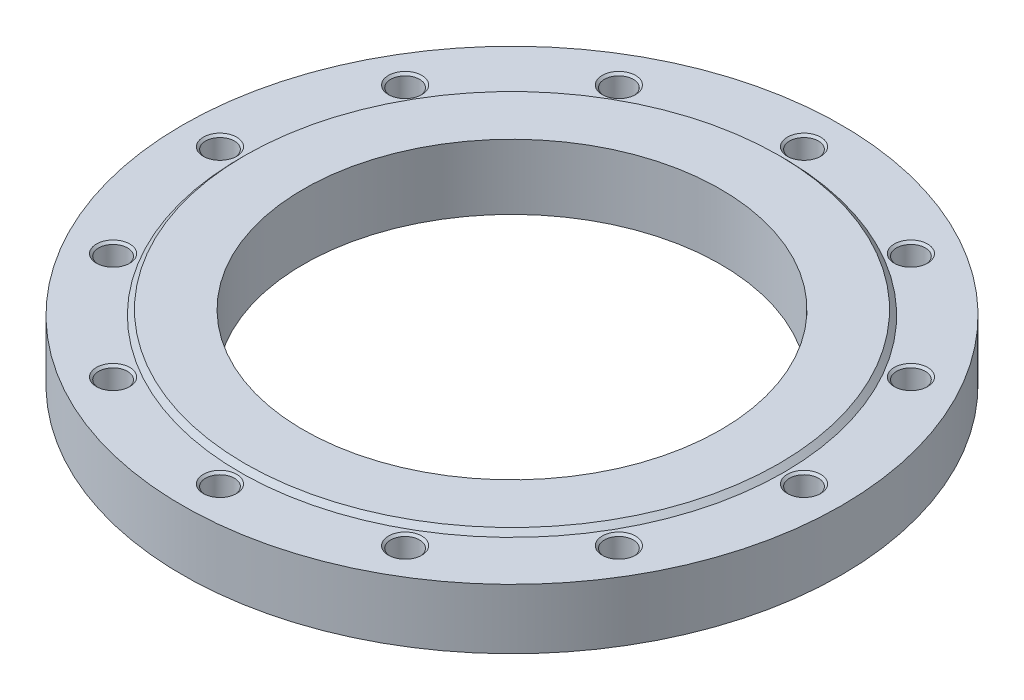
ISO-10303-21;
HEADER;
FILE_DESCRIPTION(('STEP AP214'),'2;1');
FILE_NAME('part.step','',(''),(''),'','','');
FILE_SCHEMA(('AUTOMOTIVE_DESIGN { 1 0 10303 214 1 1 1 1 }'));
ENDSEC;
DATA;
#1=APPLICATION_CONTEXT('core data for automotive mechanical design processes');
#2=APPLICATION_PROTOCOL_DEFINITION('international standard','automotive_design',2000,#1);
#3=PRODUCT_CONTEXT('',#1,'mechanical');
#4=PRODUCT('Part','Part','',(#3));
#5=PRODUCT_RELATED_PRODUCT_CATEGORY('part','',(#4));
#6=PRODUCT_DEFINITION_FORMATION('','',#4);
#7=PRODUCT_DEFINITION_CONTEXT('part definition',#1,'design');
#8=PRODUCT_DEFINITION('design','',#6,#7);
#9=PRODUCT_DEFINITION_SHAPE('','',#8);
#10=(LENGTH_UNIT() NAMED_UNIT(*) SI_UNIT(.MILLI.,.METRE.));
#11=(NAMED_UNIT(*) PLANE_ANGLE_UNIT() SI_UNIT($,.RADIAN.));
#12=(NAMED_UNIT(*) SI_UNIT($,.STERADIAN.) SOLID_ANGLE_UNIT());
#13=UNCERTAINTY_MEASURE_WITH_UNIT(LENGTH_MEASURE(1.E-05),#10,'distance_accuracy_value','');
#14=(GEOMETRIC_REPRESENTATION_CONTEXT(3) GLOBAL_UNCERTAINTY_ASSIGNED_CONTEXT((#13)) GLOBAL_UNIT_ASSIGNED_CONTEXT((#10,
#11,#12)) REPRESENTATION_CONTEXT('',''));
#15=CARTESIAN_POINT('',(0.,0.,0.));
#16=DIRECTION('',(0.,0.,1.));
#17=DIRECTION('',(1.,0.,0.));
#18=AXIS2_PLACEMENT_3D('',#15,#16,#17);
#19=CARTESIAN_POINT('',(0.,18.,0.));
#20=DIRECTION('',(0.,-1.,0.));
#21=DIRECTION('',(1.,0.,0.));
#22=AXIS2_PLACEMENT_3D('',#19,#20,#21);
#23=CYLINDRICAL_SURFACE('',#22,197.5);
#24=CARTESIAN_POINT('',(0.,0.,0.));
#25=DIRECTION('',(0.,1.,0.));
#26=DIRECTION('',(1.,0.,0.));
#27=AXIS2_PLACEMENT_3D('',#24,#25,#26);
#28=CIRCLE('',#27,197.5);
#29=CARTESIAN_POINT('',(197.5,0.,0.));
#30=VERTEX_POINT('',#29);
#31=EDGE_CURVE('E9',#30,#30,#28,.T.);
#32=ORIENTED_EDGE('',*,*,#31,.T.);
#33=EDGE_LOOP('',(#32));
#34=FACE_BOUND('',#33,.T.);
#35=CARTESIAN_POINT('',(0.,36.,0.));
#36=DIRECTION('',(0.,1.,0.));
#37=DIRECTION('',(1.,0.,0.));
#38=AXIS2_PLACEMENT_3D('',#35,#36,#37);
#39=CIRCLE('',#38,197.5);
#40=CARTESIAN_POINT('',(197.5,36.,0.));
#41=VERTEX_POINT('',#40);
#42=EDGE_CURVE('E530',#41,#41,#39,.T.);
#43=ORIENTED_EDGE('',*,*,#42,.F.);
#44=EDGE_LOOP('',(#43));
#45=FACE_BOUND('',#44,.T.);
#46=ADVANCED_FACE('F15',(#34,#45),#23,.T.);
#47=CARTESIAN_POINT('',(161.25,0.,0.));
#48=DIRECTION('',(0.,-1.,0.));
#49=DIRECTION('',(-1.,0.,0.));
#50=AXIS2_PLACEMENT_3D('',#47,#48,#49);
#51=PLANE('',#50);
#52=CARTESIAN_POINT('',(0.,0.,0.));
#53=DIRECTION('',(0.,1.,0.));
#54=DIRECTION('',(1.,0.,0.));
#55=AXIS2_PLACEMENT_3D('',#52,#53,#54);
#56=CIRCLE('',#55,125.);
#57=CARTESIAN_POINT('',(125.,0.,0.));
#58=VERTEX_POINT('',#57);
#59=EDGE_CURVE('E19',#58,#58,#56,.T.);
#60=ORIENTED_EDGE('',*,*,#59,.T.);
#61=EDGE_LOOP('',(#60));
#62=FACE_BOUND('',#61,.T.);
#63=ORIENTED_EDGE('',*,*,#31,.F.);
#64=EDGE_LOOP('',(#63));
#65=FACE_BOUND('',#64,.T.);
#66=ADVANCED_FACE('F316',(#62,#65),#51,.T.);
#67=CARTESIAN_POINT('',(0.,19.5,0.));
#68=DIRECTION('',(0.,-1.,0.));
#69=DIRECTION('',(1.,0.,0.));
#70=AXIS2_PLACEMENT_3D('',#67,#68,#69);
#71=CYLINDRICAL_SURFACE('',#70,125.);
#72=CARTESIAN_POINT('',(0.,39.,0.));
#73=DIRECTION('',(0.,1.,0.));
#74=DIRECTION('',(1.,0.,0.));
#75=AXIS2_PLACEMENT_3D('',#72,#73,#74);
#76=CIRCLE('',#75,125.);
#77=CARTESIAN_POINT('',(125.,39.,0.));
#78=VERTEX_POINT('',#77);
#79=EDGE_CURVE('E529',#78,#78,#76,.T.);
#80=ORIENTED_EDGE('',*,*,#79,.T.);
#81=EDGE_LOOP('',(#80));
#82=FACE_BOUND('',#81,.T.);
#83=ORIENTED_EDGE('',*,*,#59,.F.);
#84=EDGE_LOOP('',(#83));
#85=FACE_BOUND('',#84,.T.);
#86=ADVANCED_FACE('F321',(#82,#85),#71,.F.);
#87=CARTESIAN_POINT('',(142.5,39.,0.));
#88=DIRECTION('',(0.,1.,0.));
#89=DIRECTION('',(1.,0.,0.));
#90=AXIS2_PLACEMENT_3D('',#87,#88,#89);
#91=PLANE('',#90);
#92=CARTESIAN_POINT('',(0.,39.,0.));
#93=DIRECTION('',(0.,1.,0.));
#94=DIRECTION('',(1.,0.,0.));
#95=AXIS2_PLACEMENT_3D('',#92,#93,#94);
#96=CIRCLE('',#95,160.);
#97=CARTESIAN_POINT('',(160.,39.,0.));
#98=VERTEX_POINT('',#97);
#99=EDGE_CURVE('E527',#98,#98,#96,.T.);
#100=ORIENTED_EDGE('',*,*,#99,.T.);
#101=EDGE_LOOP('',(#100));
#102=FACE_BOUND('',#101,.T.);
#103=ORIENTED_EDGE('',*,*,#79,.F.);
#104=EDGE_LOOP('',(#103));
#105=FACE_BOUND('',#104,.T.);
#106=ADVANCED_FACE('F399',(#102,#105),#91,.T.);
#107=CARTESIAN_POINT('',(0.,37.5,0.));
#108=DIRECTION('',(0.,-1.,0.));
#109=DIRECTION('',(1.,0.,0.));
#110=AXIS2_PLACEMENT_3D('',#107,#108,#109);
#111=CONICAL_SURFACE('',#110,161.5,0.785398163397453);
#112=CARTESIAN_POINT('',(0.,36.,0.));
#113=DIRECTION('',(0.,1.,0.));
#114=DIRECTION('',(1.,0.,0.));
#115=AXIS2_PLACEMENT_3D('',#112,#113,#114);
#116=CIRCLE('',#115,163.);
#117=CARTESIAN_POINT('',(163.,36.,0.));
#118=VERTEX_POINT('',#117);
#119=EDGE_CURVE('E585',#118,#118,#116,.T.);
#120=ORIENTED_EDGE('',*,*,#119,.T.);
#121=EDGE_LOOP('',(#120));
#122=FACE_BOUND('',#121,.T.);
#123=ORIENTED_EDGE('',*,*,#99,.F.);
#124=EDGE_LOOP('',(#123));
#125=FACE_BOUND('',#124,.T.);
#126=ADVANCED_FACE('F17',(#122,#125),#111,.T.);
#127=CARTESIAN_POINT('',(180.25,36.,0.));
#128=DIRECTION('',(0.,1.,0.));
#129=DIRECTION('',(1.,0.,0.));
#130=AXIS2_PLACEMENT_3D('',#127,#128,#129);
#131=PLANE('',#130);
#132=ORIENTED_EDGE('',*,*,#42,.T.);
#133=EDGE_LOOP('',(#132));
#134=FACE_BOUND('',#133,.T.);
#135=ORIENTED_EDGE('',*,*,#119,.F.);
#136=EDGE_LOOP('',(#135));
#137=FACE_BOUND('',#136,.T.);
#138=CARTESIAN_POINT('',(175.,36.,0.));
#139=DIRECTION('',(0.,-1.,0.));
#140=DIRECTION('',(1.,0.,0.));
#141=AXIS2_PLACEMENT_3D('',#138,#139,#140);
#142=CIRCLE('',#141,10.);
#143=CARTESIAN_POINT('',(185.,36.,0.));
#144=VERTEX_POINT('',#143);
#145=EDGE_CURVE('E572',#144,#144,#142,.T.);
#146=ORIENTED_EDGE('',*,*,#145,.T.);
#147=EDGE_LOOP('',(#146));
#148=FACE_BOUND('',#147,.T.);
#149=CARTESIAN_POINT('',(151.554445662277,36.,-87.5));
#150=DIRECTION('',(0.,-1.,0.));
#151=DIRECTION('',(0.866025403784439,0.,-0.5));
#152=AXIS2_PLACEMENT_3D('',#149,#150,#151);
#153=CIRCLE('',#152,10.);
#154=CARTESIAN_POINT('',(160.214699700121,36.,-92.5));
#155=VERTEX_POINT('',#154);
#156=EDGE_CURVE('E492',#155,#155,#153,.T.);
#157=ORIENTED_EDGE('',*,*,#156,.T.);
#158=EDGE_LOOP('',(#157));
#159=FACE_BOUND('',#158,.T.);
#160=CARTESIAN_POINT('',(87.5,36.,-151.554445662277));
#161=DIRECTION('',(0.,-1.,0.));
#162=DIRECTION('',(0.5,0.,-0.866025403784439));
#163=AXIS2_PLACEMENT_3D('',#160,#161,#162);
#164=CIRCLE('',#163,10.);
#165=CARTESIAN_POINT('',(92.5,36.,-160.214699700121));
#166=VERTEX_POINT('',#165);
#167=EDGE_CURVE('E544',#166,#166,#164,.T.);
#168=ORIENTED_EDGE('',*,*,#167,.T.);
#169=EDGE_LOOP('',(#168));
#170=FACE_BOUND('',#169,.T.);
#171=CARTESIAN_POINT('',(0.,36.,-175.));
#172=DIRECTION('',(0.,-1.,0.));
#173=DIRECTION('',(0.,0.,-1.));
#174=AXIS2_PLACEMENT_3D('',#171,#172,#173);
#175=CIRCLE('',#174,10.);
#176=CARTESIAN_POINT('',(0.,36.,-185.));
#177=VERTEX_POINT('',#176);
#178=EDGE_CURVE('E574',#177,#177,#175,.T.);
#179=ORIENTED_EDGE('',*,*,#178,.T.);
#180=EDGE_LOOP('',(#179));
#181=FACE_BOUND('',#180,.T.);
#182=CARTESIAN_POINT('',(-87.5,36.,-151.554445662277));
#183=DIRECTION('',(0.,-1.,0.));
#184=DIRECTION('',(-0.5,0.,-0.866025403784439));
#185=AXIS2_PLACEMENT_3D('',#182,#183,#184);
#186=CIRCLE('',#185,10.);
#187=CARTESIAN_POINT('',(-92.5,36.,-160.214699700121));
#188=VERTEX_POINT('',#187);
#189=EDGE_CURVE('E559',#188,#188,#186,.T.);
#190=ORIENTED_EDGE('',*,*,#189,.T.);
#191=EDGE_LOOP('',(#190));
#192=FACE_BOUND('',#191,.T.);
#193=CARTESIAN_POINT('',(-151.554445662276,36.,-87.5));
#194=DIRECTION('',(0.,-1.,0.));
#195=DIRECTION('',(-0.866025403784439,0.,-0.5));
#196=AXIS2_PLACEMENT_3D('',#193,#194,#195);
#197=CIRCLE('',#196,10.);
#198=CARTESIAN_POINT('',(-160.214699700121,36.,-92.5));
#199=VERTEX_POINT('',#198);
#200=EDGE_CURVE('E540',#199,#199,#197,.T.);
#201=ORIENTED_EDGE('',*,*,#200,.T.);
#202=EDGE_LOOP('',(#201));
#203=FACE_BOUND('',#202,.T.);
#204=CARTESIAN_POINT('',(-175.,36.,0.));
#205=DIRECTION('',(0.,-1.,0.));
#206=DIRECTION('',(-1.,0.,0.));
#207=AXIS2_PLACEMENT_3D('',#204,#205,#206);
#208=CIRCLE('',#207,10.);
#209=CARTESIAN_POINT('',(-185.,36.,0.));
#210=VERTEX_POINT('',#209);
#211=EDGE_CURVE('E524',#210,#210,#208,.T.);
#212=ORIENTED_EDGE('',*,*,#211,.T.);
#213=EDGE_LOOP('',(#212));
#214=FACE_BOUND('',#213,.T.);
#215=CARTESIAN_POINT('',(-151.554445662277,36.,87.5));
#216=DIRECTION('',(0.,-1.,0.));
#217=DIRECTION('',(-0.866025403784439,0.,0.5));
#218=AXIS2_PLACEMENT_3D('',#215,#216,#217);
#219=CIRCLE('',#218,10.);
#220=CARTESIAN_POINT('',(-160.214699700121,36.,92.5));
#221=VERTEX_POINT('',#220);
#222=EDGE_CURVE('E511',#221,#221,#219,.T.);
#223=ORIENTED_EDGE('',*,*,#222,.T.);
#224=EDGE_LOOP('',(#223));
#225=FACE_BOUND('',#224,.T.);
#226=CARTESIAN_POINT('',(-87.5,36.,151.554445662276));
#227=DIRECTION('',(0.,-1.,0.));
#228=DIRECTION('',(-0.5,0.,0.866025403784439));
#229=AXIS2_PLACEMENT_3D('',#226,#227,#228);
#230=CIRCLE('',#229,10.);
#231=CARTESIAN_POINT('',(-92.5,36.,160.214699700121));
#232=VERTEX_POINT('',#231);
#233=EDGE_CURVE('E501',#232,#232,#230,.T.);
#234=ORIENTED_EDGE('',*,*,#233,.T.);
#235=EDGE_LOOP('',(#234));
#236=FACE_BOUND('',#235,.T.);
#237=CARTESIAN_POINT('',(0.,36.,175.));
#238=DIRECTION('',(0.,-1.,0.));
#239=DIRECTION('',(0.,0.,1.));
#240=AXIS2_PLACEMENT_3D('',#237,#238,#239);
#241=CIRCLE('',#240,10.);
#242=CARTESIAN_POINT('',(0.,36.,185.));
#243=VERTEX_POINT('',#242);
#244=EDGE_CURVE('E629',#243,#243,#241,.T.);
#245=ORIENTED_EDGE('',*,*,#244,.T.);
#246=EDGE_LOOP('',(#245));
#247=FACE_BOUND('',#246,.T.);
#248=CARTESIAN_POINT('',(87.5,36.,151.554445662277));
#249=DIRECTION('',(0.,-1.,0.));
#250=DIRECTION('',(0.5,0.,0.866025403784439));
#251=AXIS2_PLACEMENT_3D('',#248,#249,#250);
#252=CIRCLE('',#251,10.);
#253=CARTESIAN_POINT('',(92.5,36.,160.214699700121));
#254=VERTEX_POINT('',#253);
#255=EDGE_CURVE('E632',#254,#254,#252,.T.);
#256=ORIENTED_EDGE('',*,*,#255,.T.);
#257=EDGE_LOOP('',(#256));
#258=FACE_BOUND('',#257,.T.);
#259=CARTESIAN_POINT('',(151.554445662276,36.,87.5));
#260=DIRECTION('',(0.,-1.,0.));
#261=DIRECTION('',(0.866025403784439,0.,0.5));
#262=AXIS2_PLACEMENT_3D('',#259,#260,#261);
#263=CIRCLE('',#262,10.);
#264=CARTESIAN_POINT('',(160.214699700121,36.,92.5));
#265=VERTEX_POINT('',#264);
#266=EDGE_CURVE('E634',#265,#265,#263,.T.);
#267=ORIENTED_EDGE('',*,*,#266,.T.);
#268=EDGE_LOOP('',(#267));
#269=FACE_BOUND('',#268,.T.);
#270=ADVANCED_FACE('F604',(#134,#137,#148,#159,#170,#181,#192,#203,#214,#225,#236,#247,#258,
#269),#131,.T.);
#271=CARTESIAN_POINT('',(175.,5.50386219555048,0.));
#272=DIRECTION('',(0.,1.,0.));
#273=DIRECTION('',(1.,0.,0.));
#274=AXIS2_PLACEMENT_3D('',#271,#272,#273);
#275=CONICAL_SURFACE('',#274,4.3234375,1.0471975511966);
#276=CARTESIAN_POINT('',(175.,8.,0.));
#277=DIRECTION('',(0.,-1.,0.));
#278=DIRECTION('',(1.,0.,0.));
#279=AXIS2_PLACEMENT_3D('',#276,#277,#278);
#280=CIRCLE('',#279,8.646875);
#281=CARTESIAN_POINT('',(183.646875,8.,0.));
#282=VERTEX_POINT('',#281);
#283=EDGE_CURVE('E583',#282,#282,#280,.T.);
#284=ORIENTED_EDGE('',*,*,#283,.F.);
#285=EDGE_LOOP('',(#284));
#286=FACE_BOUND('',#285,.T.);
#287=CARTESIAN_POINT('',(175.,3.00772439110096,0.));
#288=VERTEX_POINT('',#287);
#289=VERTEX_LOOP('',#288);
#290=FACE_BOUND('',#289,.T.);
#291=ADVANCED_FACE('F607',(#286,#290),#275,.F.);
#292=CARTESIAN_POINT('',(175.,11.3234375,0.));
#293=DIRECTION('',(0.,1.,0.));
#294=DIRECTION('',(1.,0.,0.));
#295=AXIS2_PLACEMENT_3D('',#292,#293,#294);
#296=CYLINDRICAL_SURFACE('',#295,8.646875);
#297=CARTESIAN_POINT('',(175.,14.646875,0.));
#298=DIRECTION('',(0.,-1.,0.));
#299=DIRECTION('',(1.,0.,0.));
#300=AXIS2_PLACEMENT_3D('',#297,#298,#299);
#301=CIRCLE('',#300,8.646875);
#302=CARTESIAN_POINT('',(183.646875,14.646875,0.));
#303=VERTEX_POINT('',#302);
#304=EDGE_CURVE('E586',#303,#303,#301,.T.);
#305=ORIENTED_EDGE('',*,*,#304,.F.);
#306=EDGE_LOOP('',(#305));
#307=FACE_BOUND('',#306,.T.);
#308=ORIENTED_EDGE('',*,*,#283,.T.);
#309=EDGE_LOOP('',(#308));
#310=FACE_BOUND('',#309,.T.);
#311=ADVANCED_FACE('F946',(#307,#310),#296,.F.);
#312=CARTESIAN_POINT('',(175.,15.3234375,0.));
#313=DIRECTION('',(0.,1.,0.));
#314=DIRECTION('',(1.,0.,0.));
#315=AXIS2_PLACEMENT_3D('',#312,#313,#314);
#316=CONICAL_SURFACE('',#315,9.3234375,0.785398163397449);
#317=CARTESIAN_POINT('',(175.,16.,0.));
#318=DIRECTION('',(0.,-1.,0.));
#319=DIRECTION('',(1.,0.,0.));
#320=AXIS2_PLACEMENT_3D('',#317,#318,#319);
#321=CIRCLE('',#320,10.);
#322=CARTESIAN_POINT('',(185.,16.,0.));
#323=VERTEX_POINT('',#322);
#324=EDGE_CURVE('E599',#323,#323,#321,.T.);
#325=ORIENTED_EDGE('',*,*,#324,.F.);
#326=EDGE_LOOP('',(#325));
#327=FACE_BOUND('',#326,.T.);
#328=ORIENTED_EDGE('',*,*,#304,.T.);
#329=EDGE_LOOP('',(#328));
#330=FACE_BOUND('',#329,.T.);
#331=ADVANCED_FACE('F936',(#327,#330),#316,.F.);
#332=CARTESIAN_POINT('',(184.3234375,16.,0.));
#333=DIRECTION('',(0.,1.,0.));
#334=DIRECTION('',(-1.,0.,0.));
#335=AXIS2_PLACEMENT_3D('',#332,#333,#334);
#336=PLANE('',#335);
#337=CARTESIAN_POINT('',(175.,16.,0.));
#338=DIRECTION('',(0.,-1.,0.));
#339=DIRECTION('',(1.,0.,0.));
#340=AXIS2_PLACEMENT_3D('',#337,#338,#339);
#341=CIRCLE('',#340,8.646875);
#342=CARTESIAN_POINT('',(183.646875,16.,0.));
#343=VERTEX_POINT('',#342);
#344=EDGE_CURVE('E597',#343,#343,#341,.T.);
#345=ORIENTED_EDGE('',*,*,#344,.F.);
#346=EDGE_LOOP('',(#345));
#347=FACE_BOUND('',#346,.T.);
#348=ORIENTED_EDGE('',*,*,#324,.T.);
#349=EDGE_LOOP('',(#348));
#350=FACE_BOUND('',#349,.T.);
#351=ADVANCED_FACE('F926',(#347,#350),#336,.F.);
#352=CARTESIAN_POINT('',(175.,25.3234375,0.));
#353=DIRECTION('',(0.,1.,0.));
#354=DIRECTION('',(1.,0.,0.));
#355=AXIS2_PLACEMENT_3D('',#352,#353,#354);
#356=CYLINDRICAL_SURFACE('',#355,8.646875);
#357=CARTESIAN_POINT('',(175.,34.646875,0.));
#358=DIRECTION('',(0.,-1.,0.));
#359=DIRECTION('',(1.,0.,0.));
#360=AXIS2_PLACEMENT_3D('',#357,#358,#359);
#361=CIRCLE('',#360,8.646875);
#362=CARTESIAN_POINT('',(183.646875,34.646875,0.));
#363=VERTEX_POINT('',#362);
#364=EDGE_CURVE('E570',#363,#363,#361,.T.);
#365=ORIENTED_EDGE('',*,*,#364,.F.);
#366=EDGE_LOOP('',(#365));
#367=FACE_BOUND('',#366,.T.);
#368=ORIENTED_EDGE('',*,*,#344,.T.);
#369=EDGE_LOOP('',(#368));
#370=FACE_BOUND('',#369,.T.);
#371=ADVANCED_FACE('F310',(#367,#370),#356,.F.);
#372=CARTESIAN_POINT('',(175.,35.3234375,0.));
#373=DIRECTION('',(0.,1.,0.));
#374=DIRECTION('',(1.,0.,0.));
#375=AXIS2_PLACEMENT_3D('',#372,#373,#374);
#376=CONICAL_SURFACE('',#375,9.3234375,0.785398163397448);
#377=ORIENTED_EDGE('',*,*,#145,.F.);
#378=EDGE_LOOP('',(#377));
#379=FACE_BOUND('',#378,.T.);
#380=ORIENTED_EDGE('',*,*,#364,.T.);
#381=EDGE_LOOP('',(#380));
#382=FACE_BOUND('',#381,.T.);
#383=ADVANCED_FACE('F299',(#379,#382),#376,.F.);
#384=CARTESIAN_POINT('',(151.554445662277,5.50386219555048,-87.5));
#385=DIRECTION('',(0.,1.,0.));
#386=DIRECTION('',(0.866025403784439,0.,-0.5));
#387=AXIS2_PLACEMENT_3D('',#384,#385,#386);
#388=CONICAL_SURFACE('',#387,4.3234375,1.0471975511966);
#389=CARTESIAN_POINT('',(151.554445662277,8.,-87.5));
#390=DIRECTION('',(0.,-1.,0.));
#391=DIRECTION('',(0.866025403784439,0.,-0.5));
#392=AXIS2_PLACEMENT_3D('',#389,#390,#391);
#393=CIRCLE('',#392,8.646875);
#394=CARTESIAN_POINT('',(159.042859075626,8.,-91.8234375));
#395=VERTEX_POINT('',#394);
#396=EDGE_CURVE('E490',#395,#395,#393,.T.);
#397=ORIENTED_EDGE('',*,*,#396,.F.);
#398=EDGE_LOOP('',(#397));
#399=FACE_BOUND('',#398,.T.);
#400=CARTESIAN_POINT('',(151.554445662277,3.00772439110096,-87.5));
#401=VERTEX_POINT('',#400);
#402=VERTEX_LOOP('',#401);
#403=FACE_BOUND('',#402,.T.);
#404=ADVANCED_FACE('F296',(#399,#403),#388,.F.);
#405=CARTESIAN_POINT('',(151.554445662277,11.3234375,-87.5));
#406=DIRECTION('',(0.,1.,0.));
#407=DIRECTION('',(0.866025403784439,0.,-0.5));
#408=AXIS2_PLACEMENT_3D('',#405,#406,#407);
#409=CYLINDRICAL_SURFACE('',#408,8.646875);
#410=CARTESIAN_POINT('',(151.554445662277,14.646875,-87.5));
#411=DIRECTION('',(0.,-1.,0.));
#412=DIRECTION('',(0.866025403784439,0.,-0.5));
#413=AXIS2_PLACEMENT_3D('',#410,#411,#412);
#414=CIRCLE('',#413,8.646875);
#415=CARTESIAN_POINT('',(159.042859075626,14.646875,-91.8234375));
#416=VERTEX_POINT('',#415);
#417=EDGE_CURVE('E488',#416,#416,#414,.T.);
#418=ORIENTED_EDGE('',*,*,#417,.F.);
#419=EDGE_LOOP('',(#418));
#420=FACE_BOUND('',#419,.T.);
#421=ORIENTED_EDGE('',*,*,#396,.T.);
#422=EDGE_LOOP('',(#421));
#423=FACE_BOUND('',#422,.T.);
#424=ADVANCED_FACE('F298',(#420,#423),#409,.F.);
#425=CARTESIAN_POINT('',(151.554445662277,15.3234375,-87.5));
#426=DIRECTION('',(0.,1.,0.));
#427=DIRECTION('',(0.866025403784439,0.,-0.5));
#428=AXIS2_PLACEMENT_3D('',#425,#426,#427);
#429=CONICAL_SURFACE('',#428,9.3234375,0.785398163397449);
#430=CARTESIAN_POINT('',(151.554445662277,16.,-87.5));
#431=DIRECTION('',(0.,-1.,0.));
#432=DIRECTION('',(0.866025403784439,0.,-0.5));
#433=AXIS2_PLACEMENT_3D('',#430,#431,#432);
#434=CIRCLE('',#433,10.);
#435=CARTESIAN_POINT('',(160.214699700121,16.,-92.5));
#436=VERTEX_POINT('',#435);
#437=EDGE_CURVE('E487',#436,#436,#434,.T.);
#438=ORIENTED_EDGE('',*,*,#437,.F.);
#439=EDGE_LOOP('',(#438));
#440=FACE_BOUND('',#439,.T.);
#441=ORIENTED_EDGE('',*,*,#417,.T.);
#442=EDGE_LOOP('',(#441));
#443=FACE_BOUND('',#442,.T.);
#444=ADVANCED_FACE('F307',(#440,#443),#429,.F.);
#445=CARTESIAN_POINT('',(159.628779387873,16.,-92.16171875));
#446=DIRECTION('',(0.,1.,0.));
#447=DIRECTION('',(-0.866025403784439,0.,0.5));
#448=AXIS2_PLACEMENT_3D('',#445,#446,#447);
#449=PLANE('',#448);
#450=CARTESIAN_POINT('',(151.554445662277,16.,-87.5));
#451=DIRECTION('',(0.,-1.,0.));
#452=DIRECTION('',(0.866025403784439,0.,-0.5));
#453=AXIS2_PLACEMENT_3D('',#450,#451,#452);
#454=CIRCLE('',#453,8.646875);
#455=CARTESIAN_POINT('',(159.042859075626,16.,-91.8234375));
#456=VERTEX_POINT('',#455);
#457=EDGE_CURVE('E485',#456,#456,#454,.T.);
#458=ORIENTED_EDGE('',*,*,#457,.F.);
#459=EDGE_LOOP('',(#458));
#460=FACE_BOUND('',#459,.T.);
#461=ORIENTED_EDGE('',*,*,#437,.T.);
#462=EDGE_LOOP('',(#461));
#463=FACE_BOUND('',#462,.T.);
#464=ADVANCED_FACE('F448',(#460,#463),#449,.F.);
#465=CARTESIAN_POINT('',(151.554445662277,25.3234375,-87.5));
#466=DIRECTION('',(0.,1.,0.));
#467=DIRECTION('',(0.866025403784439,0.,-0.5));
#468=AXIS2_PLACEMENT_3D('',#465,#466,#467);
#469=CYLINDRICAL_SURFACE('',#468,8.646875);
#470=CARTESIAN_POINT('',(151.554445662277,34.646875,-87.5));
#471=DIRECTION('',(0.,-1.,0.));
#472=DIRECTION('',(0.866025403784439,0.,-0.5));
#473=AXIS2_PLACEMENT_3D('',#470,#471,#472);
#474=CIRCLE('',#473,8.646875);
#475=CARTESIAN_POINT('',(159.042859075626,34.646875,-91.8234375));
#476=VERTEX_POINT('',#475);
#477=EDGE_CURVE('E593',#476,#476,#474,.T.);
#478=ORIENTED_EDGE('',*,*,#477,.F.);
#479=EDGE_LOOP('',(#478));
#480=FACE_BOUND('',#479,.T.);
#481=ORIENTED_EDGE('',*,*,#457,.T.);
#482=EDGE_LOOP('',(#481));
#483=FACE_BOUND('',#482,.T.);
#484=ADVANCED_FACE('F475',(#480,#483),#469,.F.);
#485=CARTESIAN_POINT('',(151.554445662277,35.3234375,-87.5));
#486=DIRECTION('',(0.,1.,0.));
#487=DIRECTION('',(0.866025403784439,0.,-0.5));
#488=AXIS2_PLACEMENT_3D('',#485,#486,#487);
#489=CONICAL_SURFACE('',#488,9.3234375,0.785398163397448);
#490=ORIENTED_EDGE('',*,*,#156,.F.);
#491=EDGE_LOOP('',(#490));
#492=FACE_BOUND('',#491,.T.);
#493=ORIENTED_EDGE('',*,*,#477,.T.);
#494=EDGE_LOOP('',(#493));
#495=FACE_BOUND('',#494,.T.);
#496=ADVANCED_FACE('F471',(#492,#495),#489,.F.);
#497=CARTESIAN_POINT('',(87.5,5.50386219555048,-151.554445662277));
#498=DIRECTION('',(0.,1.,0.));
#499=DIRECTION('',(0.5,0.,-0.866025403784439));
#500=AXIS2_PLACEMENT_3D('',#497,#498,#499);
#501=CONICAL_SURFACE('',#500,4.3234375,1.0471975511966);
#502=CARTESIAN_POINT('',(87.5,8.,-151.554445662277));
#503=DIRECTION('',(0.,-1.,0.));
#504=DIRECTION('',(0.5,0.,-0.866025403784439));
#505=AXIS2_PLACEMENT_3D('',#502,#503,#504);
#506=CIRCLE('',#505,8.646875);
#507=CARTESIAN_POINT('',(91.8234375,8.,-159.042859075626));
#508=VERTEX_POINT('',#507);
#509=EDGE_CURVE('E549',#508,#508,#506,.T.);
#510=ORIENTED_EDGE('',*,*,#509,.F.);
#511=EDGE_LOOP('',(#510));
#512=FACE_BOUND('',#511,.T.);
#513=CARTESIAN_POINT('',(87.5,3.00772439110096,-151.554445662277));
#514=VERTEX_POINT('',#513);
#515=VERTEX_LOOP('',#514);
#516=FACE_BOUND('',#515,.T.);
#517=ADVANCED_FACE('F467',(#512,#516),#501,.F.);
#518=CARTESIAN_POINT('',(87.5,11.3234375,-151.554445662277));
#519=DIRECTION('',(0.,1.,0.));
#520=DIRECTION('',(0.5,0.,-0.866025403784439));
#521=AXIS2_PLACEMENT_3D('',#518,#519,#520);
#522=CYLINDRICAL_SURFACE('',#521,8.646875);
#523=CARTESIAN_POINT('',(87.5,14.646875,-151.554445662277));
#524=DIRECTION('',(0.,-1.,0.));
#525=DIRECTION('',(0.5,0.,-0.866025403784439));
#526=AXIS2_PLACEMENT_3D('',#523,#524,#525);
#527=CIRCLE('',#526,8.646875);
#528=CARTESIAN_POINT('',(91.8234375,14.646875,-159.042859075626));
#529=VERTEX_POINT('',#528);
#530=EDGE_CURVE('E547',#529,#529,#527,.T.);
#531=ORIENTED_EDGE('',*,*,#530,.F.);
#532=EDGE_LOOP('',(#531));
#533=FACE_BOUND('',#532,.T.);
#534=ORIENTED_EDGE('',*,*,#509,.T.);
#535=EDGE_LOOP('',(#534));
#536=FACE_BOUND('',#535,.T.);
#537=ADVANCED_FACE('F391',(#533,#536),#522,.F.);
#538=CARTESIAN_POINT('',(87.5,15.3234375,-151.554445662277));
#539=DIRECTION('',(0.,1.,0.));
#540=DIRECTION('',(0.5,0.,-0.866025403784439));
#541=AXIS2_PLACEMENT_3D('',#538,#539,#540);
#542=CONICAL_SURFACE('',#541,9.3234375,0.785398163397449);
#543=CARTESIAN_POINT('',(87.5,16.,-151.554445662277));
#544=DIRECTION('',(0.,-1.,0.));
#545=DIRECTION('',(0.5,0.,-0.866025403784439));
#546=AXIS2_PLACEMENT_3D('',#543,#544,#545);
#547=CIRCLE('',#546,10.);
#548=CARTESIAN_POINT('',(92.5,16.,-160.214699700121));
#549=VERTEX_POINT('',#548);
#550=EDGE_CURVE('E543',#549,#549,#547,.T.);
#551=ORIENTED_EDGE('',*,*,#550,.F.);
#552=EDGE_LOOP('',(#551));
#553=FACE_BOUND('',#552,.T.);
#554=ORIENTED_EDGE('',*,*,#530,.T.);
#555=EDGE_LOOP('',(#554));
#556=FACE_BOUND('',#555,.T.);
#557=ADVANCED_FACE('F387',(#553,#556),#542,.F.);
#558=CARTESIAN_POINT('',(92.16171875,16.,-159.628779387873));
#559=DIRECTION('',(0.,1.,0.));
#560=DIRECTION('',(-0.5,0.,0.866025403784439));
#561=AXIS2_PLACEMENT_3D('',#558,#559,#560);
#562=PLANE('',#561);
#563=CARTESIAN_POINT('',(87.5,16.,-151.554445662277));
#564=DIRECTION('',(0.,-1.,0.));
#565=DIRECTION('',(0.5,0.,-0.866025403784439));
#566=AXIS2_PLACEMENT_3D('',#563,#564,#565);
#567=CIRCLE('',#566,8.646875);
#568=CARTESIAN_POINT('',(91.8234375,16.,-159.042859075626));
#569=VERTEX_POINT('',#568);
#570=EDGE_CURVE('E541',#569,#569,#567,.T.);
#571=ORIENTED_EDGE('',*,*,#570,.F.);
#572=EDGE_LOOP('',(#571));
#573=FACE_BOUND('',#572,.T.);
#574=ORIENTED_EDGE('',*,*,#550,.T.);
#575=EDGE_LOOP('',(#574));
#576=FACE_BOUND('',#575,.T.);
#577=ADVANCED_FACE('F390',(#573,#576),#562,.F.);
#578=CARTESIAN_POINT('',(87.5,25.3234375,-151.554445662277));
#579=DIRECTION('',(0.,1.,0.));
#580=DIRECTION('',(0.5,0.,-0.866025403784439));
#581=AXIS2_PLACEMENT_3D('',#578,#579,#580);
#582=CYLINDRICAL_SURFACE('',#581,8.646875);
#583=CARTESIAN_POINT('',(87.5,34.646875,-151.554445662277));
#584=DIRECTION('',(0.,-1.,0.));
#585=DIRECTION('',(0.5,0.,-0.866025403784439));
#586=AXIS2_PLACEMENT_3D('',#583,#584,#585);
#587=CIRCLE('',#586,8.646875);
#588=CARTESIAN_POINT('',(91.8234375,34.646875,-159.042859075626));
#589=VERTEX_POINT('',#588);
#590=EDGE_CURVE('E588',#589,#589,#587,.T.);
#591=ORIENTED_EDGE('',*,*,#590,.F.);
#592=EDGE_LOOP('',(#591));
#593=FACE_BOUND('',#592,.T.);
#594=ORIENTED_EDGE('',*,*,#570,.T.);
#595=EDGE_LOOP('',(#594));
#596=FACE_BOUND('',#595,.T.);
#597=ADVANCED_FACE('F457',(#593,#596),#582,.F.);
#598=CARTESIAN_POINT('',(87.5,35.3234375,-151.554445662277));
#599=DIRECTION('',(0.,1.,0.));
#600=DIRECTION('',(0.5,0.,-0.866025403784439));
#601=AXIS2_PLACEMENT_3D('',#598,#599,#600);
#602=CONICAL_SURFACE('',#601,9.3234375,0.785398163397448);
#603=ORIENTED_EDGE('',*,*,#167,.F.);
#604=EDGE_LOOP('',(#603));
#605=FACE_BOUND('',#604,.T.);
#606=ORIENTED_EDGE('',*,*,#590,.T.);
#607=EDGE_LOOP('',(#606));
#608=FACE_BOUND('',#607,.T.);
#609=ADVANCED_FACE('F454',(#605,#608),#602,.F.);
#610=CARTESIAN_POINT('',(0.,5.50386219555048,-175.));
#611=DIRECTION('',(0.,1.,0.));
#612=DIRECTION('',(0.,0.,-1.));
#613=AXIS2_PLACEMENT_3D('',#610,#611,#612);
#614=CONICAL_SURFACE('',#613,4.3234375,1.0471975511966);
#615=CARTESIAN_POINT('',(0.,8.,-175.));
#616=DIRECTION('',(0.,-1.,0.));
#617=DIRECTION('',(0.,0.,-1.));
#618=AXIS2_PLACEMENT_3D('',#615,#616,#617);
#619=CIRCLE('',#618,8.646875);
#620=CARTESIAN_POINT('',(0.,8.,-183.646875));
#621=VERTEX_POINT('',#620);
#622=EDGE_CURVE('E582',#621,#621,#619,.T.);
#623=ORIENTED_EDGE('',*,*,#622,.F.);
#624=EDGE_LOOP('',(#623));
#625=FACE_BOUND('',#624,.T.);
#626=CARTESIAN_POINT('',(0.,3.00772439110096,-175.));
#627=VERTEX_POINT('',#626);
#628=VERTEX_LOOP('',#627);
#629=FACE_BOUND('',#628,.T.);
#630=ADVANCED_FACE('F452',(#625,#629),#614,.F.);
#631=CARTESIAN_POINT('',(0.,11.3234375,-175.));
#632=DIRECTION('',(0.,1.,0.));
#633=DIRECTION('',(0.,0.,-1.));
#634=AXIS2_PLACEMENT_3D('',#631,#632,#633);
#635=CYLINDRICAL_SURFACE('',#634,8.646875);
#636=CARTESIAN_POINT('',(0.,14.646875,-175.));
#637=DIRECTION('',(0.,-1.,0.));
#638=DIRECTION('',(0.,0.,-1.));
#639=AXIS2_PLACEMENT_3D('',#636,#637,#638);
#640=CIRCLE('',#639,8.646875);
#641=CARTESIAN_POINT('',(0.,14.646875,-183.646875));
#642=VERTEX_POINT('',#641);
#643=EDGE_CURVE('E580',#642,#642,#640,.T.);
#644=ORIENTED_EDGE('',*,*,#643,.F.);
#645=EDGE_LOOP('',(#644));
#646=FACE_BOUND('',#645,.T.);
#647=ORIENTED_EDGE('',*,*,#622,.T.);
#648=EDGE_LOOP('',(#647));
#649=FACE_BOUND('',#648,.T.);
#650=ADVANCED_FACE('F444',(#646,#649),#635,.F.);
#651=CARTESIAN_POINT('',(0.,15.3234375,-175.));
#652=DIRECTION('',(0.,1.,0.));
#653=DIRECTION('',(0.,0.,-1.));
#654=AXIS2_PLACEMENT_3D('',#651,#652,#653);
#655=CONICAL_SURFACE('',#654,9.3234375,0.785398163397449);
#656=CARTESIAN_POINT('',(0.,16.,-175.));
#657=DIRECTION('',(0.,-1.,0.));
#658=DIRECTION('',(0.,0.,-1.));
#659=AXIS2_PLACEMENT_3D('',#656,#657,#658);
#660=CIRCLE('',#659,10.);
#661=CARTESIAN_POINT('',(0.,16.,-185.));
#662=VERTEX_POINT('',#661);
#663=EDGE_CURVE('E578',#662,#662,#660,.T.);
#664=ORIENTED_EDGE('',*,*,#663,.F.);
#665=EDGE_LOOP('',(#664));
#666=FACE_BOUND('',#665,.T.);
#667=ORIENTED_EDGE('',*,*,#643,.T.);
#668=EDGE_LOOP('',(#667));
#669=FACE_BOUND('',#668,.T.);
#670=ADVANCED_FACE('F440',(#666,#669),#655,.F.);
#671=CARTESIAN_POINT('',(0.,16.,-184.3234375));
#672=DIRECTION('',(0.,1.,0.));
#673=DIRECTION('',(0.,0.,1.));
#674=AXIS2_PLACEMENT_3D('',#671,#672,#673);
#675=PLANE('',#674);
#676=CARTESIAN_POINT('',(0.,16.,-175.));
#677=DIRECTION('',(0.,-1.,0.));
#678=DIRECTION('',(0.,0.,-1.));
#679=AXIS2_PLACEMENT_3D('',#676,#677,#678);
#680=CIRCLE('',#679,8.646875);
#681=CARTESIAN_POINT('',(0.,16.,-183.646875));
#682=VERTEX_POINT('',#681);
#683=EDGE_CURVE('E576',#682,#682,#680,.T.);
#684=ORIENTED_EDGE('',*,*,#683,.F.);
#685=EDGE_LOOP('',(#684));
#686=FACE_BOUND('',#685,.T.);
#687=ORIENTED_EDGE('',*,*,#663,.T.);
#688=EDGE_LOOP('',(#687));
#689=FACE_BOUND('',#688,.T.);
#690=ADVANCED_FACE('F437',(#686,#689),#675,.F.);
#691=CARTESIAN_POINT('',(0.,25.3234375,-175.));
#692=DIRECTION('',(0.,1.,0.));
#693=DIRECTION('',(0.,0.,-1.));
#694=AXIS2_PLACEMENT_3D('',#691,#692,#693);
#695=CYLINDRICAL_SURFACE('',#694,8.646875);
#696=CARTESIAN_POINT('',(0.,34.646875,-175.));
#697=DIRECTION('',(0.,-1.,0.));
#698=DIRECTION('',(0.,0.,-1.));
#699=AXIS2_PLACEMENT_3D('',#696,#697,#698);
#700=CIRCLE('',#699,8.646875);
#701=CARTESIAN_POINT('',(0.,34.646875,-183.646875));
#702=VERTEX_POINT('',#701);
#703=EDGE_CURVE('E569',#702,#702,#700,.T.);
#704=ORIENTED_EDGE('',*,*,#703,.F.);
#705=EDGE_LOOP('',(#704));
#706=FACE_BOUND('',#705,.T.);
#707=ORIENTED_EDGE('',*,*,#683,.T.);
#708=EDGE_LOOP('',(#707));
#709=FACE_BOUND('',#708,.T.);
#710=ADVANCED_FACE('F435',(#706,#709),#695,.F.);
#711=CARTESIAN_POINT('',(0.,35.3234375,-175.));
#712=DIRECTION('',(0.,1.,0.));
#713=DIRECTION('',(0.,0.,-1.));
#714=AXIS2_PLACEMENT_3D('',#711,#712,#713);
#715=CONICAL_SURFACE('',#714,9.3234375,0.785398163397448);
#716=ORIENTED_EDGE('',*,*,#178,.F.);
#717=EDGE_LOOP('',(#716));
#718=FACE_BOUND('',#717,.T.);
#719=ORIENTED_EDGE('',*,*,#703,.T.);
#720=EDGE_LOOP('',(#719));
#721=FACE_BOUND('',#720,.T.);
#722=ADVANCED_FACE('F431',(#718,#721),#715,.F.);
#723=CARTESIAN_POINT('',(-87.5,5.50386219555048,-151.554445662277));
#724=DIRECTION('',(0.,1.,0.));
#725=DIRECTION('',(-0.5,0.,-0.866025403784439));
#726=AXIS2_PLACEMENT_3D('',#723,#724,#725);
#727=CONICAL_SURFACE('',#726,4.3234375,1.0471975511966);
#728=CARTESIAN_POINT('',(-87.5,8.,-151.554445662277));
#729=DIRECTION('',(0.,-1.,0.));
#730=DIRECTION('',(-0.5,0.,-0.866025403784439));
#731=AXIS2_PLACEMENT_3D('',#728,#729,#730);
#732=CIRCLE('',#731,8.646875);
#733=CARTESIAN_POINT('',(-91.8234375,8.,-159.042859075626));
#734=VERTEX_POINT('',#733);
#735=EDGE_CURVE('E567',#734,#734,#732,.T.);
#736=ORIENTED_EDGE('',*,*,#735,.F.);
#737=EDGE_LOOP('',(#736));
#738=FACE_BOUND('',#737,.T.);
#739=CARTESIAN_POINT('',(-87.5,3.00772439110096,-151.554445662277));
#740=VERTEX_POINT('',#739);
#741=VERTEX_LOOP('',#740);
#742=FACE_BOUND('',#741,.T.);
#743=ADVANCED_FACE('F427',(#738,#742),#727,.F.);
#744=CARTESIAN_POINT('',(-87.5,11.3234375,-151.554445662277));
#745=DIRECTION('',(0.,1.,0.));
#746=DIRECTION('',(-0.5,0.,-0.866025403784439));
#747=AXIS2_PLACEMENT_3D('',#744,#745,#746);
#748=CYLINDRICAL_SURFACE('',#747,8.646875);
#749=CARTESIAN_POINT('',(-87.5,14.646875,-151.554445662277));
#750=DIRECTION('',(0.,-1.,0.));
#751=DIRECTION('',(-0.5,0.,-0.866025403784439));
#752=AXIS2_PLACEMENT_3D('',#749,#750,#751);
#753=CIRCLE('',#752,8.646875);
#754=CARTESIAN_POINT('',(-91.8234375,14.646875,-159.042859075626));
#755=VERTEX_POINT('',#754);
#756=EDGE_CURVE('E565',#755,#755,#753,.T.);
#757=ORIENTED_EDGE('',*,*,#756,.F.);
#758=EDGE_LOOP('',(#757));
#759=FACE_BOUND('',#758,.T.);
#760=ORIENTED_EDGE('',*,*,#735,.T.);
#761=EDGE_LOOP('',(#760));
#762=FACE_BOUND('',#761,.T.);
#763=ADVANCED_FACE('F424',(#759,#762),#748,.F.);
#764=CARTESIAN_POINT('',(-87.5,15.3234375,-151.554445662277));
#765=DIRECTION('',(0.,1.,0.));
#766=DIRECTION('',(-0.5,0.,-0.866025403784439));
#767=AXIS2_PLACEMENT_3D('',#764,#765,#766);
#768=CONICAL_SURFACE('',#767,9.3234375,0.785398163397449);
#769=CARTESIAN_POINT('',(-87.5,16.,-151.554445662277));
#770=DIRECTION('',(0.,-1.,0.));
#771=DIRECTION('',(-0.5,0.,-0.866025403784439));
#772=AXIS2_PLACEMENT_3D('',#769,#770,#771);
#773=CIRCLE('',#772,10.);
#774=CARTESIAN_POINT('',(-92.5,16.,-160.214699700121));
#775=VERTEX_POINT('',#774);
#776=EDGE_CURVE('E563',#775,#775,#773,.T.);
#777=ORIENTED_EDGE('',*,*,#776,.F.);
#778=EDGE_LOOP('',(#777));
#779=FACE_BOUND('',#778,.T.);
#780=ORIENTED_EDGE('',*,*,#756,.T.);
#781=EDGE_LOOP('',(#780));
#782=FACE_BOUND('',#781,.T.);
#783=ADVANCED_FACE('F422',(#779,#782),#768,.F.);
#784=CARTESIAN_POINT('',(-92.16171875,16.,-159.628779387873));
#785=DIRECTION('',(0.,1.,0.));
#786=DIRECTION('',(0.5,0.,0.866025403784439));
#787=AXIS2_PLACEMENT_3D('',#784,#785,#786);
#788=PLANE('',#787);
#789=CARTESIAN_POINT('',(-87.5,16.,-151.554445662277));
#790=DIRECTION('',(0.,-1.,0.));
#791=DIRECTION('',(-0.5,0.,-0.866025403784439));
#792=AXIS2_PLACEMENT_3D('',#789,#790,#791);
#793=CIRCLE('',#792,8.646875);
#794=CARTESIAN_POINT('',(-91.8234375,16.,-159.042859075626));
#795=VERTEX_POINT('',#794);
#796=EDGE_CURVE('E560',#795,#795,#793,.T.);
#797=ORIENTED_EDGE('',*,*,#796,.F.);
#798=EDGE_LOOP('',(#797));
#799=FACE_BOUND('',#798,.T.);
#800=ORIENTED_EDGE('',*,*,#776,.T.);
#801=EDGE_LOOP('',(#800));
#802=FACE_BOUND('',#801,.T.);
#803=ADVANCED_FACE('F417',(#799,#802),#788,.F.);
#804=CARTESIAN_POINT('',(-87.5,25.3234375,-151.554445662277));
#805=DIRECTION('',(0.,1.,0.));
#806=DIRECTION('',(-0.5,0.,-0.866025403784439));
#807=AXIS2_PLACEMENT_3D('',#804,#805,#806);
#808=CYLINDRICAL_SURFACE('',#807,8.646875);
#809=CARTESIAN_POINT('',(-87.5,34.646875,-151.554445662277));
#810=DIRECTION('',(0.,-1.,0.));
#811=DIRECTION('',(-0.5,0.,-0.866025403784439));
#812=AXIS2_PLACEMENT_3D('',#809,#810,#811);
#813=CIRCLE('',#812,8.646875);
#814=CARTESIAN_POINT('',(-91.8234375,34.646875,-159.042859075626));
#815=VERTEX_POINT('',#814);
#816=EDGE_CURVE('E557',#815,#815,#813,.T.);
#817=ORIENTED_EDGE('',*,*,#816,.F.);
#818=EDGE_LOOP('',(#817));
#819=FACE_BOUND('',#818,.T.);
#820=ORIENTED_EDGE('',*,*,#796,.T.);
#821=EDGE_LOOP('',(#820));
#822=FACE_BOUND('',#821,.T.);
#823=ADVANCED_FACE('F414',(#819,#822),#808,.F.);
#824=CARTESIAN_POINT('',(-87.5,35.3234375,-151.554445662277));
#825=DIRECTION('',(0.,1.,0.));
#826=DIRECTION('',(-0.5,0.,-0.866025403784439));
#827=AXIS2_PLACEMENT_3D('',#824,#825,#826);
#828=CONICAL_SURFACE('',#827,9.3234375,0.785398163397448);
#829=ORIENTED_EDGE('',*,*,#189,.F.);
#830=EDGE_LOOP('',(#829));
#831=FACE_BOUND('',#830,.T.);
#832=ORIENTED_EDGE('',*,*,#816,.T.);
#833=EDGE_LOOP('',(#832));
#834=FACE_BOUND('',#833,.T.);
#835=ADVANCED_FACE('F410',(#831,#834),#828,.F.);
#836=CARTESIAN_POINT('',(-151.554445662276,5.50386219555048,-87.5));
#837=DIRECTION('',(0.,1.,0.));
#838=DIRECTION('',(-0.866025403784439,0.,-0.5));
#839=AXIS2_PLACEMENT_3D('',#836,#837,#838);
#840=CONICAL_SURFACE('',#839,4.3234375,1.0471975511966);
#841=CARTESIAN_POINT('',(-151.554445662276,8.,-87.5));
#842=DIRECTION('',(0.,-1.,0.));
#843=DIRECTION('',(-0.866025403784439,0.,-0.5));
#844=AXIS2_PLACEMENT_3D('',#841,#842,#843);
#845=CIRCLE('',#844,8.646875);
#846=CARTESIAN_POINT('',(-159.042859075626,8.,-91.8234375));
#847=VERTEX_POINT('',#846);
#848=EDGE_CURVE('E555',#847,#847,#845,.T.);
#849=ORIENTED_EDGE('',*,*,#848,.F.);
#850=EDGE_LOOP('',(#849));
#851=FACE_BOUND('',#850,.T.);
#852=CARTESIAN_POINT('',(-151.554445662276,3.00772439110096,-87.5));
#853=VERTEX_POINT('',#852);
#854=VERTEX_LOOP('',#853);
#855=FACE_BOUND('',#854,.T.);
#856=ADVANCED_FACE('F403',(#851,#855),#840,.F.);
#857=CARTESIAN_POINT('',(-151.554445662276,11.3234375,-87.5));
#858=DIRECTION('',(0.,1.,0.));
#859=DIRECTION('',(-0.866025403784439,0.,-0.5));
#860=AXIS2_PLACEMENT_3D('',#857,#858,#859);
#861=CYLINDRICAL_SURFACE('',#860,8.646875);
#862=CARTESIAN_POINT('',(-151.554445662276,14.646875,-87.5));
#863=DIRECTION('',(0.,-1.,0.));
#864=DIRECTION('',(-0.866025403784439,0.,-0.5));
#865=AXIS2_PLACEMENT_3D('',#862,#863,#864);
#866=CIRCLE('',#865,8.646875);
#867=CARTESIAN_POINT('',(-159.042859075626,14.646875,-91.8234375));
#868=VERTEX_POINT('',#867);
#869=EDGE_CURVE('E553',#868,#868,#866,.T.);
#870=ORIENTED_EDGE('',*,*,#869,.F.);
#871=EDGE_LOOP('',(#870));
#872=FACE_BOUND('',#871,.T.);
#873=ORIENTED_EDGE('',*,*,#848,.T.);
#874=EDGE_LOOP('',(#873));
#875=FACE_BOUND('',#874,.T.);
#876=ADVANCED_FACE('F395',(#872,#875),#861,.F.);
#877=CARTESIAN_POINT('',(-151.554445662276,15.3234375,-87.5));
#878=DIRECTION('',(0.,1.,0.));
#879=DIRECTION('',(-0.866025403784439,0.,-0.5));
#880=AXIS2_PLACEMENT_3D('',#877,#878,#879);
#881=CONICAL_SURFACE('',#880,9.3234375,0.785398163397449);
#882=CARTESIAN_POINT('',(-151.554445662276,16.,-87.5));
#883=DIRECTION('',(0.,-1.,0.));
#884=DIRECTION('',(-0.866025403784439,0.,-0.5));
#885=AXIS2_PLACEMENT_3D('',#882,#883,#884);
#886=CIRCLE('',#885,10.);
#887=CARTESIAN_POINT('',(-160.214699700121,16.,-92.5));
#888=VERTEX_POINT('',#887);
#889=EDGE_CURVE('E551',#888,#888,#886,.T.);
#890=ORIENTED_EDGE('',*,*,#889,.F.);
#891=EDGE_LOOP('',(#890));
#892=FACE_BOUND('',#891,.T.);
#893=ORIENTED_EDGE('',*,*,#869,.T.);
#894=EDGE_LOOP('',(#893));
#895=FACE_BOUND('',#894,.T.);
#896=ADVANCED_FACE('F385',(#892,#895),#881,.F.);
#897=CARTESIAN_POINT('',(-159.628779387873,16.,-92.1617187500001));
#898=DIRECTION('',(0.,1.,0.));
#899=DIRECTION('',(0.866025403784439,0.,0.5));
#900=AXIS2_PLACEMENT_3D('',#897,#898,#899);
#901=PLANE('',#900);
#902=CARTESIAN_POINT('',(-151.554445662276,16.,-87.5));
#903=DIRECTION('',(0.,-1.,0.));
#904=DIRECTION('',(-0.866025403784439,0.,-0.5));
#905=AXIS2_PLACEMENT_3D('',#902,#903,#904);
#906=CIRCLE('',#905,8.646875);
#907=CARTESIAN_POINT('',(-159.042859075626,16.,-91.8234375));
#908=VERTEX_POINT('',#907);
#909=EDGE_CURVE('E546',#908,#908,#906,.T.);
#910=ORIENTED_EDGE('',*,*,#909,.F.);
#911=EDGE_LOOP('',(#910));
#912=FACE_BOUND('',#911,.T.);
#913=ORIENTED_EDGE('',*,*,#889,.T.);
#914=EDGE_LOOP('',(#913));
#915=FACE_BOUND('',#914,.T.);
#916=ADVANCED_FACE('F382',(#912,#915),#901,.F.);
#917=CARTESIAN_POINT('',(-151.554445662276,25.3234375,-87.5));
#918=DIRECTION('',(0.,1.,0.));
#919=DIRECTION('',(-0.866025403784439,0.,-0.5));
#920=AXIS2_PLACEMENT_3D('',#917,#918,#919);
#921=CYLINDRICAL_SURFACE('',#920,8.646875);
#922=CARTESIAN_POINT('',(-151.554445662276,34.646875,-87.5));
#923=DIRECTION('',(0.,-1.,0.));
#924=DIRECTION('',(-0.866025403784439,0.,-0.5));
#925=AXIS2_PLACEMENT_3D('',#922,#923,#924);
#926=CIRCLE('',#925,8.646875);
#927=CARTESIAN_POINT('',(-159.042859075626,34.646875,-91.8234375));
#928=VERTEX_POINT('',#927);
#929=EDGE_CURVE('E538',#928,#928,#926,.T.);
#930=ORIENTED_EDGE('',*,*,#929,.F.);
#931=EDGE_LOOP('',(#930));
#932=FACE_BOUND('',#931,.T.);
#933=ORIENTED_EDGE('',*,*,#909,.T.);
#934=EDGE_LOOP('',(#933));
#935=FACE_BOUND('',#934,.T.);
#936=ADVANCED_FACE('F380',(#932,#935),#921,.F.);
#937=CARTESIAN_POINT('',(-151.554445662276,35.3234375,-87.5));
#938=DIRECTION('',(0.,1.,0.));
#939=DIRECTION('',(-0.866025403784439,0.,-0.5));
#940=AXIS2_PLACEMENT_3D('',#937,#938,#939);
#941=CONICAL_SURFACE('',#940,9.3234375,0.785398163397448);
#942=ORIENTED_EDGE('',*,*,#200,.F.);
#943=EDGE_LOOP('',(#942));
#944=FACE_BOUND('',#943,.T.);
#945=ORIENTED_EDGE('',*,*,#929,.T.);
#946=EDGE_LOOP('',(#945));
#947=FACE_BOUND('',#946,.T.);
#948=ADVANCED_FACE('F376',(#944,#947),#941,.F.);
#949=CARTESIAN_POINT('',(-175.,5.50386219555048,0.));
#950=DIRECTION('',(0.,1.,0.));
#951=DIRECTION('',(-1.,0.,0.));
#952=AXIS2_PLACEMENT_3D('',#949,#950,#951);
#953=CONICAL_SURFACE('',#952,4.3234375,1.0471975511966);
#954=CARTESIAN_POINT('',(-175.,8.,0.));
#955=DIRECTION('',(0.,-1.,0.));
#956=DIRECTION('',(-1.,0.,0.));
#957=AXIS2_PLACEMENT_3D('',#954,#955,#956);
#958=CIRCLE('',#957,8.646875);
#959=CARTESIAN_POINT('',(-183.646875,8.,0.));
#960=VERTEX_POINT('',#959);
#961=EDGE_CURVE('E536',#960,#960,#958,.T.);
#962=ORIENTED_EDGE('',*,*,#961,.F.);
#963=EDGE_LOOP('',(#962));
#964=FACE_BOUND('',#963,.T.);
#965=CARTESIAN_POINT('',(-175.,3.00772439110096,0.));
#966=VERTEX_POINT('',#965);
#967=VERTEX_LOOP('',#966);
#968=FACE_BOUND('',#967,.T.);
#969=ADVANCED_FACE('F372',(#964,#968),#953,.F.);
#970=CARTESIAN_POINT('',(-175.,11.3234375,0.));
#971=DIRECTION('',(0.,1.,0.));
#972=DIRECTION('',(-1.,0.,0.));
#973=AXIS2_PLACEMENT_3D('',#970,#971,#972);
#974=CYLINDRICAL_SURFACE('',#973,8.646875);
#975=CARTESIAN_POINT('',(-175.,14.646875,0.));
#976=DIRECTION('',(0.,-1.,0.));
#977=DIRECTION('',(-1.,0.,0.));
#978=AXIS2_PLACEMENT_3D('',#975,#976,#977);
#979=CIRCLE('',#978,8.646875);
#980=CARTESIAN_POINT('',(-183.646875,14.646875,0.));
#981=VERTEX_POINT('',#980);
#982=EDGE_CURVE('E534',#981,#981,#979,.T.);
#983=ORIENTED_EDGE('',*,*,#982,.F.);
#984=EDGE_LOOP('',(#983));
#985=FACE_BOUND('',#984,.T.);
#986=ORIENTED_EDGE('',*,*,#961,.T.);
#987=EDGE_LOOP('',(#986));
#988=FACE_BOUND('',#987,.T.);
#989=ADVANCED_FACE('F368',(#985,#988),#974,.F.);
#990=CARTESIAN_POINT('',(-175.,15.3234375,0.));
#991=DIRECTION('',(0.,1.,0.));
#992=DIRECTION('',(-1.,0.,0.));
#993=AXIS2_PLACEMENT_3D('',#990,#991,#992);
#994=CONICAL_SURFACE('',#993,9.3234375,0.785398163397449);
#995=CARTESIAN_POINT('',(-175.,16.,0.));
#996=DIRECTION('',(0.,-1.,0.));
#997=DIRECTION('',(-1.,0.,0.));
#998=AXIS2_PLACEMENT_3D('',#995,#996,#997);
#999=CIRCLE('',#998,10.);
#1000=CARTESIAN_POINT('',(-185.,16.,0.));
#1001=VERTEX_POINT('',#1000);
#1002=EDGE_CURVE('E532',#1001,#1001,#999,.T.);
#1003=ORIENTED_EDGE('',*,*,#1002,.F.);
#1004=EDGE_LOOP('',(#1003));
#1005=FACE_BOUND('',#1004,.T.);
#1006=ORIENTED_EDGE('',*,*,#982,.T.);
#1007=EDGE_LOOP('',(#1006));
#1008=FACE_BOUND('',#1007,.T.);
#1009=ADVANCED_FACE('F364',(#1005,#1008),#994,.F.);
#1010=CARTESIAN_POINT('',(-184.3234375,16.,0.));
#1011=DIRECTION('',(0.,1.,0.));
#1012=DIRECTION('',(1.,0.,0.));
#1013=AXIS2_PLACEMENT_3D('',#1010,#1011,#1012);
#1014=PLANE('',#1013);
#1015=CARTESIAN_POINT('',(-175.,16.,0.));
#1016=DIRECTION('',(0.,-1.,0.));
#1017=DIRECTION('',(-1.,0.,0.));
#1018=AXIS2_PLACEMENT_3D('',#1015,#1016,#1017);
#1019=CIRCLE('',#1018,8.646875);
#1020=CARTESIAN_POINT('',(-183.646875,16.,0.));
#1021=VERTEX_POINT('',#1020);
#1022=EDGE_CURVE('E526',#1021,#1021,#1019,.T.);
#1023=ORIENTED_EDGE('',*,*,#1022,.F.);
#1024=EDGE_LOOP('',(#1023));
#1025=FACE_BOUND('',#1024,.T.);
#1026=ORIENTED_EDGE('',*,*,#1002,.T.);
#1027=EDGE_LOOP('',(#1026));
#1028=FACE_BOUND('',#1027,.T.);
#1029=ADVANCED_FACE('F360',(#1025,#1028),#1014,.F.);
#1030=CARTESIAN_POINT('',(-175.,25.3234375,0.));
#1031=DIRECTION('',(0.,1.,0.));
#1032=DIRECTION('',(-1.,0.,0.));
#1033=AXIS2_PLACEMENT_3D('',#1030,#1031,#1032);
#1034=CYLINDRICAL_SURFACE('',#1033,8.646875);
#1035=CARTESIAN_POINT('',(-175.,34.646875,0.));
#1036=DIRECTION('',(0.,-1.,0.));
#1037=DIRECTION('',(-1.,0.,0.));
#1038=AXIS2_PLACEMENT_3D('',#1035,#1036,#1037);
#1039=CIRCLE('',#1038,8.646875);
#1040=CARTESIAN_POINT('',(-183.646875,34.646875,0.));
#1041=VERTEX_POINT('',#1040);
#1042=EDGE_CURVE('E522',#1041,#1041,#1039,.T.);
#1043=ORIENTED_EDGE('',*,*,#1042,.F.);
#1044=EDGE_LOOP('',(#1043));
#1045=FACE_BOUND('',#1044,.T.);
#1046=ORIENTED_EDGE('',*,*,#1022,.T.);
#1047=EDGE_LOOP('',(#1046));
#1048=FACE_BOUND('',#1047,.T.);
#1049=ADVANCED_FACE('F356',(#1045,#1048),#1034,.F.);
#1050=CARTESIAN_POINT('',(-175.,35.3234375,0.));
#1051=DIRECTION('',(0.,1.,0.));
#1052=DIRECTION('',(-1.,0.,0.));
#1053=AXIS2_PLACEMENT_3D('',#1050,#1051,#1052);
#1054=CONICAL_SURFACE('',#1053,9.3234375,0.785398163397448);
#1055=ORIENTED_EDGE('',*,*,#211,.F.);
#1056=EDGE_LOOP('',(#1055));
#1057=FACE_BOUND('',#1056,.T.);
#1058=ORIENTED_EDGE('',*,*,#1042,.T.);
#1059=EDGE_LOOP('',(#1058));
#1060=FACE_BOUND('',#1059,.T.);
#1061=ADVANCED_FACE('F352',(#1057,#1060),#1054,.F.);
#1062=CARTESIAN_POINT('',(-151.554445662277,5.50386219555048,87.5));
#1063=DIRECTION('',(0.,1.,0.));
#1064=DIRECTION('',(-0.866025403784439,0.,0.5));
#1065=AXIS2_PLACEMENT_3D('',#1062,#1063,#1064);
#1066=CONICAL_SURFACE('',#1065,4.3234375,1.0471975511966);
#1067=CARTESIAN_POINT('',(-151.554445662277,8.,87.5));
#1068=DIRECTION('',(0.,-1.,0.));
#1069=DIRECTION('',(-0.866025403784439,0.,0.5));
#1070=AXIS2_PLACEMENT_3D('',#1067,#1068,#1069);
#1071=CIRCLE('',#1070,8.646875);
#1072=CARTESIAN_POINT('',(-159.042859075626,8.,91.8234374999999));
#1073=VERTEX_POINT('',#1072);
#1074=EDGE_CURVE('E520',#1073,#1073,#1071,.T.);
#1075=ORIENTED_EDGE('',*,*,#1074,.F.);
#1076=EDGE_LOOP('',(#1075));
#1077=FACE_BOUND('',#1076,.T.);
#1078=CARTESIAN_POINT('',(-151.554445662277,3.00772439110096,87.5));
#1079=VERTEX_POINT('',#1078);
#1080=VERTEX_LOOP('',#1079);
#1081=FACE_BOUND('',#1080,.T.);
#1082=ADVANCED_FACE('F348',(#1077,#1081),#1066,.F.);
#1083=CARTESIAN_POINT('',(-151.554445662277,11.3234375,87.5));
#1084=DIRECTION('',(0.,1.,0.));
#1085=DIRECTION('',(-0.866025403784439,0.,0.5));
#1086=AXIS2_PLACEMENT_3D('',#1083,#1084,#1085);
#1087=CYLINDRICAL_SURFACE('',#1086,8.646875);
#1088=CARTESIAN_POINT('',(-151.554445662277,14.646875,87.5));
#1089=DIRECTION('',(0.,-1.,0.));
#1090=DIRECTION('',(-0.866025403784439,0.,0.5));
#1091=AXIS2_PLACEMENT_3D('',#1088,#1089,#1090);
#1092=CIRCLE('',#1091,8.646875);
#1093=CARTESIAN_POINT('',(-159.042859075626,14.646875,91.8234374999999));
#1094=VERTEX_POINT('',#1093);
#1095=EDGE_CURVE('E518',#1094,#1094,#1092,.T.);
#1096=ORIENTED_EDGE('',*,*,#1095,.F.);
#1097=EDGE_LOOP('',(#1096));
#1098=FACE_BOUND('',#1097,.T.);
#1099=ORIENTED_EDGE('',*,*,#1074,.T.);
#1100=EDGE_LOOP('',(#1099));
#1101=FACE_BOUND('',#1100,.T.);
#1102=ADVANCED_FACE('F344',(#1098,#1101),#1087,.F.);
#1103=CARTESIAN_POINT('',(-151.554445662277,15.3234375,87.5));
#1104=DIRECTION('',(0.,1.,0.));
#1105=DIRECTION('',(-0.866025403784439,0.,0.5));
#1106=AXIS2_PLACEMENT_3D('',#1103,#1104,#1105);
#1107=CONICAL_SURFACE('',#1106,9.3234375,0.785398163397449);
#1108=CARTESIAN_POINT('',(-151.554445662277,16.,87.5));
#1109=DIRECTION('',(0.,-1.,0.));
#1110=DIRECTION('',(-0.866025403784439,0.,0.5));
#1111=AXIS2_PLACEMENT_3D('',#1108,#1109,#1110);
#1112=CIRCLE('',#1111,10.);
#1113=CARTESIAN_POINT('',(-160.214699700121,16.,92.5));
#1114=VERTEX_POINT('',#1113);
#1115=EDGE_CURVE('E516',#1114,#1114,#1112,.T.);
#1116=ORIENTED_EDGE('',*,*,#1115,.F.);
#1117=EDGE_LOOP('',(#1116));
#1118=FACE_BOUND('',#1117,.T.);
#1119=ORIENTED_EDGE('',*,*,#1095,.T.);
#1120=EDGE_LOOP('',(#1119));
#1121=FACE_BOUND('',#1120,.T.);
#1122=ADVANCED_FACE('F341',(#1118,#1121),#1107,.F.);
#1123=CARTESIAN_POINT('',(-159.628779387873,16.,92.16171875));
#1124=DIRECTION('',(0.,1.,0.));
#1125=DIRECTION('',(0.866025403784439,0.,-0.5));
#1126=AXIS2_PLACEMENT_3D('',#1123,#1124,#1125);
#1127=PLANE('',#1126);
#1128=CARTESIAN_POINT('',(-151.554445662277,16.,87.5));
#1129=DIRECTION('',(0.,-1.,0.));
#1130=DIRECTION('',(-0.866025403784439,0.,0.5));
#1131=AXIS2_PLACEMENT_3D('',#1128,#1129,#1130);
#1132=CIRCLE('',#1131,8.646875);
#1133=CARTESIAN_POINT('',(-159.042859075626,16.,91.8234374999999));
#1134=VERTEX_POINT('',#1133);
#1135=EDGE_CURVE('E514',#1134,#1134,#1132,.T.);
#1136=ORIENTED_EDGE('',*,*,#1135,.F.);
#1137=EDGE_LOOP('',(#1136));
#1138=FACE_BOUND('',#1137,.T.);
#1139=ORIENTED_EDGE('',*,*,#1115,.T.);
#1140=EDGE_LOOP('',(#1139));
#1141=FACE_BOUND('',#1140,.T.);
#1142=ADVANCED_FACE('F339',(#1138,#1141),#1127,.F.);
#1143=CARTESIAN_POINT('',(-151.554445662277,25.3234375,87.5));
#1144=DIRECTION('',(0.,1.,0.));
#1145=DIRECTION('',(-0.866025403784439,0.,0.5));
#1146=AXIS2_PLACEMENT_3D('',#1143,#1144,#1145);
#1147=CYLINDRICAL_SURFACE('',#1146,8.646875);
#1148=CARTESIAN_POINT('',(-151.554445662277,34.646875,87.5));
#1149=DIRECTION('',(0.,-1.,0.));
#1150=DIRECTION('',(-0.866025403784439,0.,0.5));
#1151=AXIS2_PLACEMENT_3D('',#1148,#1149,#1150);
#1152=CIRCLE('',#1151,8.646875);
#1153=CARTESIAN_POINT('',(-159.042859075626,34.646875,91.8234374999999));
#1154=VERTEX_POINT('',#1153);
#1155=EDGE_CURVE('E510',#1154,#1154,#1152,.T.);
#1156=ORIENTED_EDGE('',*,*,#1155,.F.);
#1157=EDGE_LOOP('',(#1156));
#1158=FACE_BOUND('',#1157,.T.);
#1159=ORIENTED_EDGE('',*,*,#1135,.T.);
#1160=EDGE_LOOP('',(#1159));
#1161=FACE_BOUND('',#1160,.T.);
#1162=ADVANCED_FACE('F335',(#1158,#1161),#1147,.F.);
#1163=CARTESIAN_POINT('',(-151.554445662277,35.3234375,87.5));
#1164=DIRECTION('',(0.,1.,0.));
#1165=DIRECTION('',(-0.866025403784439,0.,0.5));
#1166=AXIS2_PLACEMENT_3D('',#1163,#1164,#1165);
#1167=CONICAL_SURFACE('',#1166,9.3234375,0.785398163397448);
#1168=ORIENTED_EDGE('',*,*,#222,.F.);
#1169=EDGE_LOOP('',(#1168));
#1170=FACE_BOUND('',#1169,.T.);
#1171=ORIENTED_EDGE('',*,*,#1155,.T.);
#1172=EDGE_LOOP('',(#1171));
#1173=FACE_BOUND('',#1172,.T.);
#1174=ADVANCED_FACE('F331',(#1170,#1173),#1167,.F.);
#1175=CARTESIAN_POINT('',(-87.5,5.50386219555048,151.554445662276));
#1176=DIRECTION('',(0.,1.,0.));
#1177=DIRECTION('',(-0.5,0.,0.866025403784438));
#1178=AXIS2_PLACEMENT_3D('',#1175,#1176,#1177);
#1179=CONICAL_SURFACE('',#1178,4.3234375,1.0471975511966);
#1180=CARTESIAN_POINT('',(-87.5,8.,151.554445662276));
#1181=DIRECTION('',(0.,-1.,0.));
#1182=DIRECTION('',(-0.5,0.,0.866025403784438));
#1183=AXIS2_PLACEMENT_3D('',#1180,#1181,#1182);
#1184=CIRCLE('',#1183,8.646875);
#1185=CARTESIAN_POINT('',(-91.8234375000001,8.,159.042859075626));
#1186=VERTEX_POINT('',#1185);
#1187=EDGE_CURVE('E509',#1186,#1186,#1184,.T.);
#1188=ORIENTED_EDGE('',*,*,#1187,.F.);
#1189=EDGE_LOOP('',(#1188));
#1190=FACE_BOUND('',#1189,.T.);
#1191=CARTESIAN_POINT('',(-87.5,3.00772439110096,151.554445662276));
#1192=VERTEX_POINT('',#1191);
#1193=VERTEX_LOOP('',#1192);
#1194=FACE_BOUND('',#1193,.T.);
#1195=ADVANCED_FACE('F328',(#1190,#1194),#1179,.F.);
#1196=CARTESIAN_POINT('',(-87.5,11.3234375,151.554445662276));
#1197=DIRECTION('',(0.,1.,0.));
#1198=DIRECTION('',(-0.5,0.,0.866025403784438));
#1199=AXIS2_PLACEMENT_3D('',#1196,#1197,#1198);
#1200=CYLINDRICAL_SURFACE('',#1199,8.646875);
#1201=CARTESIAN_POINT('',(-87.5,14.646875,151.554445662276));
#1202=DIRECTION('',(0.,-1.,0.));
#1203=DIRECTION('',(-0.5,0.,0.866025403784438));
#1204=AXIS2_PLACEMENT_3D('',#1201,#1202,#1203);
#1205=CIRCLE('',#1204,8.646875);
#1206=CARTESIAN_POINT('',(-91.8234375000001,14.646875,159.042859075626));
#1207=VERTEX_POINT('',#1206);
#1208=EDGE_CURVE('E507',#1207,#1207,#1205,.T.);
#1209=ORIENTED_EDGE('',*,*,#1208,.F.);
#1210=EDGE_LOOP('',(#1209));
#1211=FACE_BOUND('',#1210,.T.);
#1212=ORIENTED_EDGE('',*,*,#1187,.T.);
#1213=EDGE_LOOP('',(#1212));
#1214=FACE_BOUND('',#1213,.T.);
#1215=ADVANCED_FACE('F326',(#1211,#1214),#1200,.F.);
#1216=CARTESIAN_POINT('',(-87.5,15.3234375,151.554445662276));
#1217=DIRECTION('',(0.,1.,0.));
#1218=DIRECTION('',(-0.5,0.,0.866025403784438));
#1219=AXIS2_PLACEMENT_3D('',#1216,#1217,#1218);
#1220=CONICAL_SURFACE('',#1219,9.3234375,0.785398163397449);
#1221=CARTESIAN_POINT('',(-87.5,16.,151.554445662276));
#1222=DIRECTION('',(0.,-1.,0.));
#1223=DIRECTION('',(-0.5,0.,0.866025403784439));
#1224=AXIS2_PLACEMENT_3D('',#1221,#1222,#1223);
#1225=CIRCLE('',#1224,10.);
#1226=CARTESIAN_POINT('',(-92.5,16.,160.214699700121));
#1227=VERTEX_POINT('',#1226);
#1228=EDGE_CURVE('E505',#1227,#1227,#1225,.T.);
#1229=ORIENTED_EDGE('',*,*,#1228,.F.);
#1230=EDGE_LOOP('',(#1229));
#1231=FACE_BOUND('',#1230,.T.);
#1232=ORIENTED_EDGE('',*,*,#1208,.T.);
#1233=EDGE_LOOP('',(#1232));
#1234=FACE_BOUND('',#1233,.T.);
#1235=ADVANCED_FACE('F698',(#1231,#1234),#1220,.F.);
#1236=CARTESIAN_POINT('',(-92.1617187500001,16.,159.628779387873));
#1237=DIRECTION('',(0.,1.,0.));
#1238=DIRECTION('',(0.5,0.,-0.866025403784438));
#1239=AXIS2_PLACEMENT_3D('',#1236,#1237,#1238);
#1240=PLANE('',#1239);
#1241=CARTESIAN_POINT('',(-87.5,16.,151.554445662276));
#1242=DIRECTION('',(0.,-1.,0.));
#1243=DIRECTION('',(-0.5,0.,0.866025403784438));
#1244=AXIS2_PLACEMENT_3D('',#1241,#1242,#1243);
#1245=CIRCLE('',#1244,8.646875);
#1246=CARTESIAN_POINT('',(-91.8234375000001,16.,159.042859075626));
#1247=VERTEX_POINT('',#1246);
#1248=EDGE_CURVE('E503',#1247,#1247,#1245,.T.);
#1249=ORIENTED_EDGE('',*,*,#1248,.F.);
#1250=EDGE_LOOP('',(#1249));
#1251=FACE_BOUND('',#1250,.T.);
#1252=ORIENTED_EDGE('',*,*,#1228,.T.);
#1253=EDGE_LOOP('',(#1252));
#1254=FACE_BOUND('',#1253,.T.);
#1255=ADVANCED_FACE('F695',(#1251,#1254),#1240,.F.);
#1256=CARTESIAN_POINT('',(-87.5,25.3234375,151.554445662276));
#1257=DIRECTION('',(0.,1.,0.));
#1258=DIRECTION('',(-0.5,0.,0.866025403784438));
#1259=AXIS2_PLACEMENT_3D('',#1256,#1257,#1258);
#1260=CYLINDRICAL_SURFACE('',#1259,8.646875);
#1261=CARTESIAN_POINT('',(-87.5,34.646875,151.554445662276));
#1262=DIRECTION('',(0.,-1.,0.));
#1263=DIRECTION('',(-0.5,0.,0.866025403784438));
#1264=AXIS2_PLACEMENT_3D('',#1261,#1262,#1263);
#1265=CIRCLE('',#1264,8.646875);
#1266=CARTESIAN_POINT('',(-91.8234375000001,34.646875,159.042859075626));
#1267=VERTEX_POINT('',#1266);
#1268=EDGE_CURVE('E500',#1267,#1267,#1265,.T.);
#1269=ORIENTED_EDGE('',*,*,#1268,.F.);
#1270=EDGE_LOOP('',(#1269));
#1271=FACE_BOUND('',#1270,.T.);
#1272=ORIENTED_EDGE('',*,*,#1248,.T.);
#1273=EDGE_LOOP('',(#1272));
#1274=FACE_BOUND('',#1273,.T.);
#1275=ADVANCED_FACE('F688',(#1271,#1274),#1260,.F.);
#1276=CARTESIAN_POINT('',(-87.5,35.3234375,151.554445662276));
#1277=DIRECTION('',(0.,1.,0.));
#1278=DIRECTION('',(-0.5,0.,0.866025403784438));
#1279=AXIS2_PLACEMENT_3D('',#1276,#1277,#1278);
#1280=CONICAL_SURFACE('',#1279,9.3234375,0.785398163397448);
#1281=ORIENTED_EDGE('',*,*,#233,.F.);
#1282=EDGE_LOOP('',(#1281));
#1283=FACE_BOUND('',#1282,.T.);
#1284=ORIENTED_EDGE('',*,*,#1268,.T.);
#1285=EDGE_LOOP('',(#1284));
#1286=FACE_BOUND('',#1285,.T.);
#1287=ADVANCED_FACE('F683',(#1283,#1286),#1280,.F.);
#1288=CARTESIAN_POINT('',(0.,5.50386219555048,175.));
#1289=DIRECTION('',(0.,1.,0.));
#1290=DIRECTION('',(0.,0.,1.));
#1291=AXIS2_PLACEMENT_3D('',#1288,#1289,#1290);
#1292=CONICAL_SURFACE('',#1291,4.3234375,1.0471975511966);
#1293=CARTESIAN_POINT('',(0.,8.,175.));
#1294=DIRECTION('',(0.,-1.,0.));
#1295=DIRECTION('',(0.,0.,1.));
#1296=AXIS2_PLACEMENT_3D('',#1293,#1294,#1295);
#1297=CIRCLE('',#1296,8.646875);
#1298=CARTESIAN_POINT('',(0.,8.,183.646875));
#1299=VERTEX_POINT('',#1298);
#1300=EDGE_CURVE('E498',#1299,#1299,#1297,.T.);
#1301=ORIENTED_EDGE('',*,*,#1300,.F.);
#1302=EDGE_LOOP('',(#1301));
#1303=FACE_BOUND('',#1302,.T.);
#1304=CARTESIAN_POINT('',(0.,3.00772439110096,175.));
#1305=VERTEX_POINT('',#1304);
#1306=VERTEX_LOOP('',#1305);
#1307=FACE_BOUND('',#1306,.T.);
#1308=ADVANCED_FACE('F677',(#1303,#1307),#1292,.F.);
#1309=CARTESIAN_POINT('',(0.,11.3234375,175.));
#1310=DIRECTION('',(0.,1.,0.));
#1311=DIRECTION('',(0.,0.,1.));
#1312=AXIS2_PLACEMENT_3D('',#1309,#1310,#1311);
#1313=CYLINDRICAL_SURFACE('',#1312,8.646875);
#1314=CARTESIAN_POINT('',(0.,14.646875,175.));
#1315=DIRECTION('',(0.,-1.,0.));
#1316=DIRECTION('',(0.,0.,1.));
#1317=AXIS2_PLACEMENT_3D('',#1314,#1315,#1316);
#1318=CIRCLE('',#1317,8.646875);
#1319=CARTESIAN_POINT('',(0.,14.646875,183.646875));
#1320=VERTEX_POINT('',#1319);
#1321=EDGE_CURVE('E496',#1320,#1320,#1318,.T.);
#1322=ORIENTED_EDGE('',*,*,#1321,.F.);
#1323=EDGE_LOOP('',(#1322));
#1324=FACE_BOUND('',#1323,.T.);
#1325=ORIENTED_EDGE('',*,*,#1300,.T.);
#1326=EDGE_LOOP('',(#1325));
#1327=FACE_BOUND('',#1326,.T.);
#1328=ADVANCED_FACE('F674',(#1324,#1327),#1313,.F.);
#1329=CARTESIAN_POINT('',(0.,15.3234375,175.));
#1330=DIRECTION('',(0.,1.,0.));
#1331=DIRECTION('',(0.,0.,1.));
#1332=AXIS2_PLACEMENT_3D('',#1329,#1330,#1331);
#1333=CONICAL_SURFACE('',#1332,9.3234375,0.785398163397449);
#1334=CARTESIAN_POINT('',(0.,16.,175.));
#1335=DIRECTION('',(0.,-1.,0.));
#1336=DIRECTION('',(0.,0.,1.));
#1337=AXIS2_PLACEMENT_3D('',#1334,#1335,#1336);
#1338=CIRCLE('',#1337,10.);
#1339=CARTESIAN_POINT('',(0.,16.,185.));
#1340=VERTEX_POINT('',#1339);
#1341=EDGE_CURVE('E667',#1340,#1340,#1338,.T.);
#1342=ORIENTED_EDGE('',*,*,#1341,.F.);
#1343=EDGE_LOOP('',(#1342));
#1344=FACE_BOUND('',#1343,.T.);
#1345=ORIENTED_EDGE('',*,*,#1321,.T.);
#1346=EDGE_LOOP('',(#1345));
#1347=FACE_BOUND('',#1346,.T.);
#1348=ADVANCED_FACE('F672',(#1344,#1347),#1333,.F.);
#1349=CARTESIAN_POINT('',(0.,16.,184.3234375));
#1350=DIRECTION('',(0.,1.,0.));
#1351=DIRECTION('',(0.,0.,-1.));
#1352=AXIS2_PLACEMENT_3D('',#1349,#1350,#1351);
#1353=PLANE('',#1352);
#1354=CARTESIAN_POINT('',(0.,16.,175.));
#1355=DIRECTION('',(0.,-1.,0.));
#1356=DIRECTION('',(0.,0.,1.));
#1357=AXIS2_PLACEMENT_3D('',#1354,#1355,#1356);
#1358=CIRCLE('',#1357,8.646875);
#1359=CARTESIAN_POINT('',(0.,16.,183.646875));
#1360=VERTEX_POINT('',#1359);
#1361=EDGE_CURVE('E645',#1360,#1360,#1358,.T.);
#1362=ORIENTED_EDGE('',*,*,#1361,.F.);
#1363=EDGE_LOOP('',(#1362));
#1364=FACE_BOUND('',#1363,.T.);
#1365=ORIENTED_EDGE('',*,*,#1341,.T.);
#1366=EDGE_LOOP('',(#1365));
#1367=FACE_BOUND('',#1366,.T.);
#1368=ADVANCED_FACE('F1024',(#1364,#1367),#1353,.F.);
#1369=CARTESIAN_POINT('',(0.,25.3234375,175.));
#1370=DIRECTION('',(0.,1.,0.));
#1371=DIRECTION('',(0.,0.,1.));
#1372=AXIS2_PLACEMENT_3D('',#1369,#1370,#1371);
#1373=CYLINDRICAL_SURFACE('',#1372,8.646875);
#1374=CARTESIAN_POINT('',(0.,34.646875,175.));
#1375=DIRECTION('',(0.,-1.,0.));
#1376=DIRECTION('',(0.,0.,1.));
#1377=AXIS2_PLACEMENT_3D('',#1374,#1375,#1376);
#1378=CIRCLE('',#1377,8.646875);
#1379=CARTESIAN_POINT('',(0.,34.646875,183.646875));
#1380=VERTEX_POINT('',#1379);
#1381=EDGE_CURVE('E646',#1380,#1380,#1378,.T.);
#1382=ORIENTED_EDGE('',*,*,#1381,.F.);
#1383=EDGE_LOOP('',(#1382));
#1384=FACE_BOUND('',#1383,.T.);
#1385=ORIENTED_EDGE('',*,*,#1361,.T.);
#1386=EDGE_LOOP('',(#1385));
#1387=FACE_BOUND('',#1386,.T.);
#1388=ADVANCED_FACE('F1021',(#1384,#1387),#1373,.F.);
#1389=CARTESIAN_POINT('',(0.,35.3234375,175.));
#1390=DIRECTION('',(0.,1.,0.));
#1391=DIRECTION('',(0.,0.,1.));
#1392=AXIS2_PLACEMENT_3D('',#1389,#1390,#1391);
#1393=CONICAL_SURFACE('',#1392,9.3234375,0.785398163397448);
#1394=ORIENTED_EDGE('',*,*,#244,.F.);
#1395=EDGE_LOOP('',(#1394));
#1396=FACE_BOUND('',#1395,.T.);
#1397=ORIENTED_EDGE('',*,*,#1381,.T.);
#1398=EDGE_LOOP('',(#1397));
#1399=FACE_BOUND('',#1398,.T.);
#1400=ADVANCED_FACE('F1023',(#1396,#1399),#1393,.F.);
#1401=CARTESIAN_POINT('',(87.5,5.50386219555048,151.554445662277));
#1402=DIRECTION('',(0.,1.,0.));
#1403=DIRECTION('',(0.5,0.,0.866025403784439));
#1404=AXIS2_PLACEMENT_3D('',#1401,#1402,#1403);
#1405=CONICAL_SURFACE('',#1404,4.3234375,1.0471975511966);
#1406=CARTESIAN_POINT('',(87.5,8.,151.554445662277));
#1407=DIRECTION('',(0.,-1.,0.));
#1408=DIRECTION('',(0.5,0.,0.866025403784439));
#1409=AXIS2_PLACEMENT_3D('',#1406,#1407,#1408);
#1410=CIRCLE('',#1409,8.646875);
#1411=CARTESIAN_POINT('',(91.8234374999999,8.,159.042859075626));
#1412=VERTEX_POINT('',#1411);
#1413=EDGE_CURVE('E647',#1412,#1412,#1410,.T.);
#1414=ORIENTED_EDGE('',*,*,#1413,.F.);
#1415=EDGE_LOOP('',(#1414));
#1416=FACE_BOUND('',#1415,.T.);
#1417=CARTESIAN_POINT('',(87.5,3.00772439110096,151.554445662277));
#1418=VERTEX_POINT('',#1417);
#1419=VERTEX_LOOP('',#1418);
#1420=FACE_BOUND('',#1419,.T.);
#1421=ADVANCED_FACE('F1049',(#1416,#1420),#1405,.F.);
#1422=CARTESIAN_POINT('',(87.5,11.3234375,151.554445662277));
#1423=DIRECTION('',(0.,1.,0.));
#1424=DIRECTION('',(0.5,0.,0.866025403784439));
#1425=AXIS2_PLACEMENT_3D('',#1422,#1423,#1424);
#1426=CYLINDRICAL_SURFACE('',#1425,8.646875);
#1427=CARTESIAN_POINT('',(87.5,14.646875,151.554445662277));
#1428=DIRECTION('',(0.,-1.,0.));
#1429=DIRECTION('',(0.5,0.,0.866025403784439));
#1430=AXIS2_PLACEMENT_3D('',#1427,#1428,#1429);
#1431=CIRCLE('',#1430,8.646875);
#1432=CARTESIAN_POINT('',(91.8234374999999,14.646875,159.042859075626));
#1433=VERTEX_POINT('',#1432);
#1434=EDGE_CURVE('E649',#1433,#1433,#1431,.T.);
#1435=ORIENTED_EDGE('',*,*,#1434,.F.);
#1436=EDGE_LOOP('',(#1435));
#1437=FACE_BOUND('',#1436,.T.);
#1438=ORIENTED_EDGE('',*,*,#1413,.T.);
#1439=EDGE_LOOP('',(#1438));
#1440=FACE_BOUND('',#1439,.T.);
#1441=ADVANCED_FACE('F1018',(#1437,#1440),#1426,.F.);
#1442=CARTESIAN_POINT('',(87.5,15.3234375,151.554445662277));
#1443=DIRECTION('',(0.,1.,0.));
#1444=DIRECTION('',(0.5,0.,0.866025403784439));
#1445=AXIS2_PLACEMENT_3D('',#1442,#1443,#1444);
#1446=CONICAL_SURFACE('',#1445,9.3234375,0.785398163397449);
#1447=CARTESIAN_POINT('',(87.5,16.,151.554445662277));
#1448=DIRECTION('',(0.,-1.,0.));
#1449=DIRECTION('',(0.5,0.,0.866025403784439));
#1450=AXIS2_PLACEMENT_3D('',#1447,#1448,#1449);
#1451=CIRCLE('',#1450,10.);
#1452=CARTESIAN_POINT('',(92.5,16.,160.214699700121));
#1453=VERTEX_POINT('',#1452);
#1454=EDGE_CURVE('E661',#1453,#1453,#1451,.T.);
#1455=ORIENTED_EDGE('',*,*,#1454,.F.);
#1456=EDGE_LOOP('',(#1455));
#1457=FACE_BOUND('',#1456,.T.);
#1458=ORIENTED_EDGE('',*,*,#1434,.T.);
#1459=EDGE_LOOP('',(#1458));
#1460=FACE_BOUND('',#1459,.T.);
#1461=ADVANCED_FACE('F1016',(#1457,#1460),#1446,.F.);
#1462=CARTESIAN_POINT('',(92.1617187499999,16.,159.628779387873));
#1463=DIRECTION('',(0.,1.,0.));
#1464=DIRECTION('',(-0.5,0.,-0.866025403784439));
#1465=AXIS2_PLACEMENT_3D('',#1462,#1463,#1464);
#1466=PLANE('',#1465);
#1467=CARTESIAN_POINT('',(87.5,16.,151.554445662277));
#1468=DIRECTION('',(0.,-1.,0.));
#1469=DIRECTION('',(0.5,0.,0.866025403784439));
#1470=AXIS2_PLACEMENT_3D('',#1467,#1468,#1469);
#1471=CIRCLE('',#1470,8.646875);
#1472=CARTESIAN_POINT('',(91.8234374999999,16.,159.042859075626));
#1473=VERTEX_POINT('',#1472);
#1474=EDGE_CURVE('E659',#1473,#1473,#1471,.T.);
#1475=ORIENTED_EDGE('',*,*,#1474,.F.);
#1476=EDGE_LOOP('',(#1475));
#1477=FACE_BOUND('',#1476,.T.);
#1478=ORIENTED_EDGE('',*,*,#1454,.T.);
#1479=EDGE_LOOP('',(#1478));
#1480=FACE_BOUND('',#1479,.T.);
#1481=ADVANCED_FACE('F1014',(#1477,#1480),#1466,.F.);
#1482=CARTESIAN_POINT('',(87.5,25.3234375,151.554445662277));
#1483=DIRECTION('',(0.,1.,0.));
#1484=DIRECTION('',(0.5,0.,0.866025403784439));
#1485=AXIS2_PLACEMENT_3D('',#1482,#1483,#1484);
#1486=CYLINDRICAL_SURFACE('',#1485,8.646875);
#1487=CARTESIAN_POINT('',(87.5,34.646875,151.554445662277));
#1488=DIRECTION('',(0.,-1.,0.));
#1489=DIRECTION('',(0.5,0.,0.866025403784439));
#1490=AXIS2_PLACEMENT_3D('',#1487,#1488,#1489);
#1491=CIRCLE('',#1490,8.646875);
#1492=CARTESIAN_POINT('',(91.8234374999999,34.646875,159.042859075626));
#1493=VERTEX_POINT('',#1492);
#1494=EDGE_CURVE('E650',#1493,#1493,#1491,.T.);
#1495=ORIENTED_EDGE('',*,*,#1494,.F.);
#1496=EDGE_LOOP('',(#1495));
#1497=FACE_BOUND('',#1496,.T.);
#1498=ORIENTED_EDGE('',*,*,#1474,.T.);
#1499=EDGE_LOOP('',(#1498));
#1500=FACE_BOUND('',#1499,.T.);
#1501=ADVANCED_FACE('F1075',(#1497,#1500),#1486,.F.);
#1502=CARTESIAN_POINT('',(87.5,35.3234375,151.554445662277));
#1503=DIRECTION('',(0.,1.,0.));
#1504=DIRECTION('',(0.5,0.,0.866025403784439));
#1505=AXIS2_PLACEMENT_3D('',#1502,#1503,#1504);
#1506=CONICAL_SURFACE('',#1505,9.3234375,0.785398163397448);
#1507=ORIENTED_EDGE('',*,*,#255,.F.);
#1508=EDGE_LOOP('',(#1507));
#1509=FACE_BOUND('',#1508,.T.);
#1510=ORIENTED_EDGE('',*,*,#1494,.T.);
#1511=EDGE_LOOP('',(#1510));
#1512=FACE_BOUND('',#1511,.T.);
#1513=ADVANCED_FACE('F1082',(#1509,#1512),#1506,.F.);
#1514=CARTESIAN_POINT('',(151.554445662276,5.50386219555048,87.5));
#1515=DIRECTION('',(0.,1.,0.));
#1516=DIRECTION('',(0.866025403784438,0.,0.5));
#1517=AXIS2_PLACEMENT_3D('',#1514,#1515,#1516);
#1518=CONICAL_SURFACE('',#1517,4.3234375,1.0471975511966);
#1519=CARTESIAN_POINT('',(151.554445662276,8.,87.5));
#1520=DIRECTION('',(0.,-1.,0.));
#1521=DIRECTION('',(0.866025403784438,0.,0.5));
#1522=AXIS2_PLACEMENT_3D('',#1519,#1520,#1521);
#1523=CIRCLE('',#1522,8.646875);
#1524=CARTESIAN_POINT('',(159.042859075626,8.,91.8234375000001));
#1525=VERTEX_POINT('',#1524);
#1526=EDGE_CURVE('E651',#1525,#1525,#1523,.T.);
#1527=ORIENTED_EDGE('',*,*,#1526,.F.);
#1528=EDGE_LOOP('',(#1527));
#1529=FACE_BOUND('',#1528,.T.);
#1530=CARTESIAN_POINT('',(151.554445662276,3.00772439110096,87.5));
#1531=VERTEX_POINT('',#1530);
#1532=VERTEX_LOOP('',#1531);
#1533=FACE_BOUND('',#1532,.T.);
#1534=ADVANCED_FACE('F1089',(#1529,#1533),#1518,.F.);
#1535=CARTESIAN_POINT('',(151.554445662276,11.3234375,87.5));
#1536=DIRECTION('',(0.,1.,0.));
#1537=DIRECTION('',(0.866025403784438,0.,0.5));
#1538=AXIS2_PLACEMENT_3D('',#1535,#1536,#1537);
#1539=CYLINDRICAL_SURFACE('',#1538,8.646875);
#1540=CARTESIAN_POINT('',(151.554445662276,14.646875,87.5));
#1541=DIRECTION('',(0.,-1.,0.));
#1542=DIRECTION('',(0.866025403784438,0.,0.5));
#1543=AXIS2_PLACEMENT_3D('',#1540,#1541,#1542);
#1544=CIRCLE('',#1543,8.646875);
#1545=CARTESIAN_POINT('',(159.042859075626,14.646875,91.8234375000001));
#1546=VERTEX_POINT('',#1545);
#1547=EDGE_CURVE('E654',#1546,#1546,#1544,.T.);
#1548=ORIENTED_EDGE('',*,*,#1547,.F.);
#1549=EDGE_LOOP('',(#1548));
#1550=FACE_BOUND('',#1549,.T.);
#1551=ORIENTED_EDGE('',*,*,#1526,.T.);
#1552=EDGE_LOOP('',(#1551));
#1553=FACE_BOUND('',#1552,.T.);
#1554=ADVANCED_FACE('F1097',(#1550,#1553),#1539,.F.);
#1555=CARTESIAN_POINT('',(151.554445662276,15.3234375,87.5));
#1556=DIRECTION('',(0.,1.,0.));
#1557=DIRECTION('',(0.866025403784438,0.,0.5));
#1558=AXIS2_PLACEMENT_3D('',#1555,#1556,#1557);
#1559=CONICAL_SURFACE('',#1558,9.3234375,0.785398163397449);
#1560=CARTESIAN_POINT('',(151.554445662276,16.,87.5));
#1561=DIRECTION('',(0.,-1.,0.));
#1562=DIRECTION('',(0.866025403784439,0.,0.5));
#1563=AXIS2_PLACEMENT_3D('',#1560,#1561,#1562);
#1564=CIRCLE('',#1563,10.);
#1565=CARTESIAN_POINT('',(160.214699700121,16.,92.5));
#1566=VERTEX_POINT('',#1565);
#1567=EDGE_CURVE('E639',#1566,#1566,#1564,.T.);
#1568=ORIENTED_EDGE('',*,*,#1567,.F.);
#1569=EDGE_LOOP('',(#1568));
#1570=FACE_BOUND('',#1569,.T.);
#1571=ORIENTED_EDGE('',*,*,#1547,.T.);
#1572=EDGE_LOOP('',(#1571));
#1573=FACE_BOUND('',#1572,.T.);
#1574=ADVANCED_FACE('F1105',(#1570,#1573),#1559,.F.);
#1575=CARTESIAN_POINT('',(159.628779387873,16.,92.1617187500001));
#1576=DIRECTION('',(0.,1.,0.));
#1577=DIRECTION('',(-0.866025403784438,0.,-0.5));
#1578=AXIS2_PLACEMENT_3D('',#1575,#1576,#1577);
#1579=PLANE('',#1578);
#1580=CARTESIAN_POINT('',(151.554445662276,16.,87.5));
#1581=DIRECTION('',(0.,-1.,0.));
#1582=DIRECTION('',(0.866025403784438,0.,0.5));
#1583=AXIS2_PLACEMENT_3D('',#1580,#1581,#1582);
#1584=CIRCLE('',#1583,8.646875);
#1585=CARTESIAN_POINT('',(159.042859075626,16.,91.8234375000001));
#1586=VERTEX_POINT('',#1585);
#1587=EDGE_CURVE('E636',#1586,#1586,#1584,.T.);
#1588=ORIENTED_EDGE('',*,*,#1587,.F.);
#1589=EDGE_LOOP('',(#1588));
#1590=FACE_BOUND('',#1589,.T.);
#1591=ORIENTED_EDGE('',*,*,#1567,.T.);
#1592=EDGE_LOOP('',(#1591));
#1593=FACE_BOUND('',#1592,.T.);
#1594=ADVANCED_FACE('F1113',(#1590,#1593),#1579,.F.);
#1595=CARTESIAN_POINT('',(151.554445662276,25.3234375,87.5));
#1596=DIRECTION('',(0.,1.,0.));
#1597=DIRECTION('',(0.866025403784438,0.,0.5));
#1598=AXIS2_PLACEMENT_3D('',#1595,#1596,#1597);
#1599=CYLINDRICAL_SURFACE('',#1598,8.646875);
#1600=CARTESIAN_POINT('',(151.554445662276,34.646875,87.5));
#1601=DIRECTION('',(0.,-1.,0.));
#1602=DIRECTION('',(0.866025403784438,0.,0.5));
#1603=AXIS2_PLACEMENT_3D('',#1600,#1601,#1602);
#1604=CIRCLE('',#1603,8.646875);
#1605=CARTESIAN_POINT('',(159.042859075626,34.646875,91.8234375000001));
#1606=VERTEX_POINT('',#1605);
#1607=EDGE_CURVE('E637',#1606,#1606,#1604,.T.);
#1608=ORIENTED_EDGE('',*,*,#1607,.F.);
#1609=EDGE_LOOP('',(#1608));
#1610=FACE_BOUND('',#1609,.T.);
#1611=ORIENTED_EDGE('',*,*,#1587,.T.);
#1612=EDGE_LOOP('',(#1611));
#1613=FACE_BOUND('',#1612,.T.);
#1614=ADVANCED_FACE('F1121',(#1610,#1613),#1599,.F.);
#1615=CARTESIAN_POINT('',(151.554445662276,35.3234375,87.5));
#1616=DIRECTION('',(0.,1.,0.));
#1617=DIRECTION('',(0.866025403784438,0.,0.5));
#1618=AXIS2_PLACEMENT_3D('',#1615,#1616,#1617);
#1619=CONICAL_SURFACE('',#1618,9.3234375,0.785398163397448);
#1620=ORIENTED_EDGE('',*,*,#266,.F.);
#1621=EDGE_LOOP('',(#1620));
#1622=FACE_BOUND('',#1621,.T.);
#1623=ORIENTED_EDGE('',*,*,#1607,.T.);
#1624=EDGE_LOOP('',(#1623));
#1625=FACE_BOUND('',#1624,.T.);
#1626=ADVANCED_FACE('F1129',(#1622,#1625),#1619,.F.);
#1627=CLOSED_SHELL('',(#46,#66,#86,#106,#126,#270,#291,#311,#331,#351,#371,#383,#404,#424,#444,
#464,#484,#496,#517,#537,#557,#577,#597,#609,#630,#650,#670,#690,#710,#722,#743,#763,#783,#803,
#823,#835,#856,#876,#896,#916,#936,#948,#969,#989,#1009,#1029,#1049,#1061,#1082,#1102,#1122,
#1142,#1162,#1174,#1195,#1215,#1235,#1255,#1275,#1287,#1308,#1328,#1348,#1368,#1388,#1400,#1421,
#1441,#1461,#1481,#1501,#1513,#1534,#1554,#1574,#1594,#1614,#1626));
#1628=MANIFOLD_SOLID_BREP('B1',#1627);
#1629=ADVANCED_BREP_SHAPE_REPRESENTATION('',(#18,#1628),#14);
#1630=SHAPE_DEFINITION_REPRESENTATION(#9,#1629);
ENDSEC;
END-ISO-10303-21;
